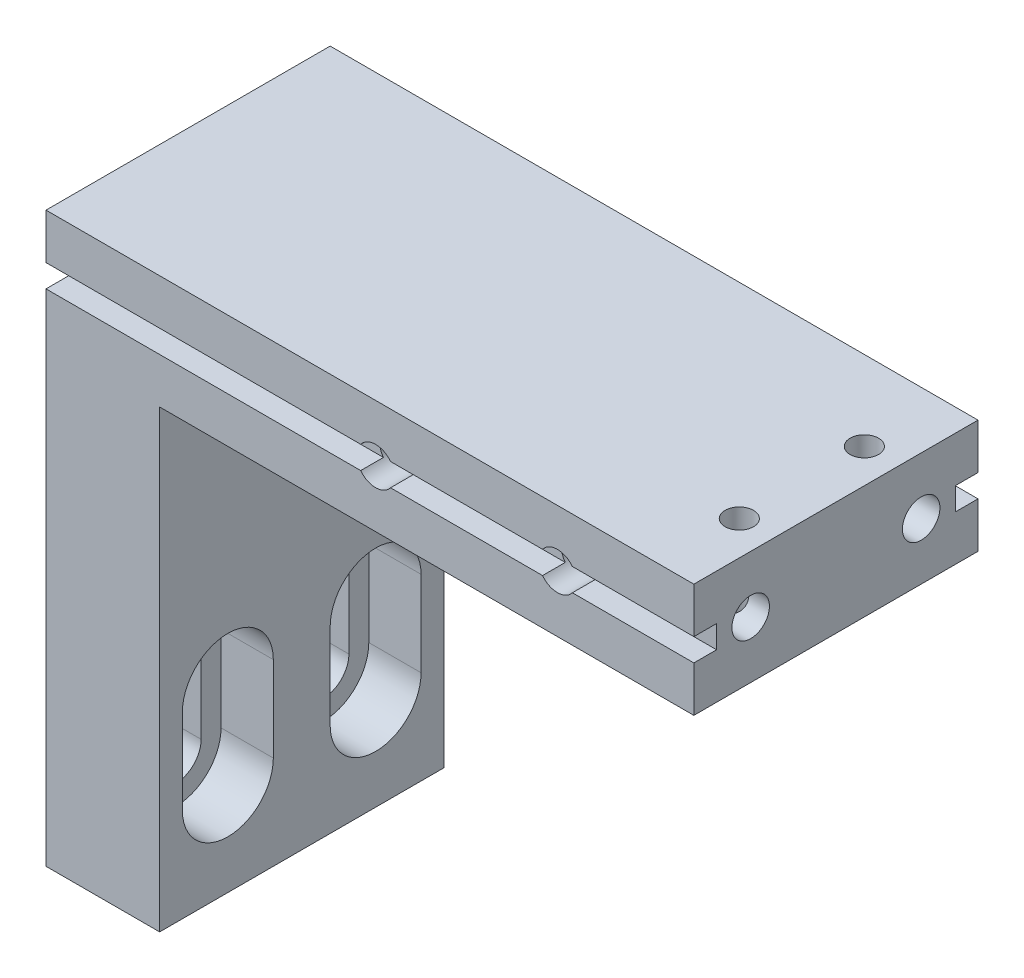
ISO-10303-21;
HEADER;
FILE_DESCRIPTION(('STEP AP214'),'2;1');
FILE_NAME('part.step','',(''),(''),'','','');
FILE_SCHEMA(('AUTOMOTIVE_DESIGN { 1 0 10303 214 1 1 1 1 }'));
ENDSEC;
DATA;
#1=APPLICATION_CONTEXT('core data for automotive mechanical design processes');
#2=APPLICATION_PROTOCOL_DEFINITION('international standard','automotive_design',2000,#1);
#3=PRODUCT_CONTEXT('',#1,'mechanical');
#4=PRODUCT('Part','Part','',(#3));
#5=PRODUCT_RELATED_PRODUCT_CATEGORY('part','',(#4));
#6=PRODUCT_DEFINITION_FORMATION('','',#4);
#7=PRODUCT_DEFINITION_CONTEXT('part definition',#1,'design');
#8=PRODUCT_DEFINITION('design','',#6,#7);
#9=PRODUCT_DEFINITION_SHAPE('','',#8);
#10=(LENGTH_UNIT() NAMED_UNIT(*) SI_UNIT(.MILLI.,.METRE.));
#11=(NAMED_UNIT(*) PLANE_ANGLE_UNIT() SI_UNIT($,.RADIAN.));
#12=(NAMED_UNIT(*) SI_UNIT($,.STERADIAN.) SOLID_ANGLE_UNIT());
#13=UNCERTAINTY_MEASURE_WITH_UNIT(LENGTH_MEASURE(1.E-05),#10,'distance_accuracy_value','');
#14=(GEOMETRIC_REPRESENTATION_CONTEXT(3) GLOBAL_UNCERTAINTY_ASSIGNED_CONTEXT((#13)) GLOBAL_UNIT_ASSIGNED_CONTEXT((#10,
#11,#12)) REPRESENTATION_CONTEXT('',''));
#15=CARTESIAN_POINT('',(0.,0.,0.));
#16=DIRECTION('',(0.,0.,1.));
#17=DIRECTION('',(1.,0.,0.));
#18=AXIS2_PLACEMENT_3D('',#15,#16,#17);
#19=CARTESIAN_POINT('',(167.,-66.7630029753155,0.));
#20=DIRECTION('',(0.,1.,0.));
#21=DIRECTION('',(0.,0.,1.));
#22=AXIS2_PLACEMENT_3D('',#19,#20,#21);
#23=PLANE('',#22);
#24=DIRECTION('',(1.,0.,0.));
#25=VECTOR('',#24,1.);
#26=CARTESIAN_POINT('',(167.,-66.7630029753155,0.));
#27=LINE('',#26,#25);
#28=CARTESIAN_POINT('',(213.31244047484,-66.7630029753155,0.));
#29=VERTEX_POINT('',#28);
#30=CARTESIAN_POINT('',(224.,-66.7630029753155,0.));
#31=VERTEX_POINT('',#30);
#32=EDGE_CURVE('E355',#29,#31,#27,.T.);
#33=ORIENTED_EDGE('',*,*,#32,.F.);
#34=DIRECTION('',(0.,0.,-1.));
#35=VECTOR('',#34,1.);
#36=CARTESIAN_POINT('',(213.31244047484,-66.7630029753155,-25.));
#37=LINE('',#36,#35);
#38=CARTESIAN_POINT('',(213.31244047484,-66.7630029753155,-2.));
#39=VERTEX_POINT('',#38);
#40=EDGE_CURVE('E333',#29,#39,#37,.T.);
#41=ORIENTED_EDGE('',*,*,#40,.T.);
#42=DIRECTION('',(1.,0.,0.));
#43=VECTOR('',#42,1.);
#44=CARTESIAN_POINT('',(167.,-66.7630029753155,-2.));
#45=LINE('',#44,#43);
#46=CARTESIAN_POINT('',(224.,-66.7630029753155,-2.));
#47=VERTEX_POINT('',#46);
#48=EDGE_CURVE('E365',#39,#47,#45,.T.);
#49=ORIENTED_EDGE('',*,*,#48,.T.);
#50=DIRECTION('',(0.,0.,1.));
#51=VECTOR('',#50,1.);
#52=CARTESIAN_POINT('',(224.,-66.7630029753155,0.));
#53=LINE('',#52,#51);
#54=EDGE_CURVE('E361',#47,#31,#53,.T.);
#55=ORIENTED_EDGE('',*,*,#54,.T.);
#56=EDGE_LOOP('',(#33,#41,#49,#55));
#57=FACE_BOUND('',#56,.T.);
#58=ADVANCED_FACE('F16',(#57),#23,.F.);
#59=CARTESIAN_POINT('',(167.,-66.7630029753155,-25.));
#60=DIRECTION('',(0.,1.,0.));
#61=DIRECTION('',(0.,0.,1.));
#62=AXIS2_PLACEMENT_3D('',#59,#60,#61);
#63=PLANE('',#62);
#64=DIRECTION('',(1.,0.,0.));
#65=VECTOR('',#64,1.);
#66=CARTESIAN_POINT('',(167.,-66.7630029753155,-23.));
#67=LINE('',#66,#65);
#68=CARTESIAN_POINT('',(213.31244047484,-66.7630029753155,-23.));
#69=VERTEX_POINT('',#68);
#70=CARTESIAN_POINT('',(224.,-66.7630029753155,-23.));
#71=VERTEX_POINT('',#70);
#72=EDGE_CURVE('E866',#69,#71,#67,.T.);
#73=ORIENTED_EDGE('',*,*,#72,.F.);
#74=DIRECTION('',(0.,0.,-1.));
#75=VECTOR('',#74,1.);
#76=CARTESIAN_POINT('',(213.31244047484,-66.7630029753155,-25.));
#77=LINE('',#76,#75);
#78=CARTESIAN_POINT('',(213.31244047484,-66.7630029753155,-25.));
#79=VERTEX_POINT('',#78);
#80=EDGE_CURVE('E933',#69,#79,#77,.T.);
#81=ORIENTED_EDGE('',*,*,#80,.T.);
#82=DIRECTION('',(1.,0.,0.));
#83=VECTOR('',#82,1.);
#84=CARTESIAN_POINT('',(167.,-66.7630029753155,-25.));
#85=LINE('',#84,#83);
#86=CARTESIAN_POINT('',(224.,-66.7630029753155,-25.));
#87=VERTEX_POINT('',#86);
#88=EDGE_CURVE('E860',#79,#87,#85,.T.);
#89=ORIENTED_EDGE('',*,*,#88,.T.);
#90=DIRECTION('',(0.,0.,1.));
#91=VECTOR('',#90,1.);
#92=CARTESIAN_POINT('',(224.,-66.7630029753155,-25.));
#93=LINE('',#92,#91);
#94=EDGE_CURVE('E875',#87,#71,#93,.T.);
#95=ORIENTED_EDGE('',*,*,#94,.T.);
#96=EDGE_LOOP('',(#73,#81,#89,#95));
#97=FACE_BOUND('',#96,.T.);
#98=ADVANCED_FACE('F710',(#97),#63,.F.);
#99=CARTESIAN_POINT('',(167.,-68.7630029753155,-2.));
#100=DIRECTION('',(0.,0.,-1.));
#101=DIRECTION('',(-1.,0.,0.));
#102=AXIS2_PLACEMENT_3D('',#99,#100,#101);
#103=PLANE('',#102);
#104=ORIENTED_EDGE('',*,*,#48,.F.);
#105=CARTESIAN_POINT('',(212.,-67.7630029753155,-2.));
#106=DIRECTION('',(0.,0.,-1.));
#107=DIRECTION('',(-1.,0.,0.));
#108=AXIS2_PLACEMENT_3D('',#105,#106,#107);
#109=CIRCLE('',#108,1.65);
#110=CARTESIAN_POINT('',(213.31244047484,-68.7630029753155,-2.));
#111=VERTEX_POINT('',#110);
#112=EDGE_CURVE('E920',#39,#111,#109,.T.);
#113=ORIENTED_EDGE('',*,*,#112,.T.);
#114=DIRECTION('',(1.,0.,0.));
#115=VECTOR('',#114,1.);
#116=CARTESIAN_POINT('',(167.,-68.7630029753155,-2.));
#117=LINE('',#116,#115);
#118=CARTESIAN_POINT('',(224.,-68.7630029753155,-2.));
#119=VERTEX_POINT('',#118);
#120=EDGE_CURVE('E370',#111,#119,#117,.T.);
#121=ORIENTED_EDGE('',*,*,#120,.T.);
#122=DIRECTION('',(0.,1.,0.));
#123=VECTOR('',#122,1.);
#124=CARTESIAN_POINT('',(224.,-68.7630029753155,-2.));
#125=LINE('',#124,#123);
#126=EDGE_CURVE('E842',#119,#47,#125,.T.);
#127=ORIENTED_EDGE('',*,*,#126,.T.);
#128=EDGE_LOOP('',(#104,#113,#121,#127));
#129=FACE_BOUND('',#128,.T.);
#130=ADVANCED_FACE('F694',(#129),#103,.F.);
#131=CARTESIAN_POINT('',(167.,-68.7630029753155,0.));
#132=DIRECTION('',(0.,-1.,0.));
#133=DIRECTION('',(0.,0.,-1.));
#134=AXIS2_PLACEMENT_3D('',#131,#132,#133);
#135=PLANE('',#134);
#136=DIRECTION('',(1.,0.,0.));
#137=VECTOR('',#136,1.);
#138=CARTESIAN_POINT('',(167.,-68.7630029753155,0.));
#139=LINE('',#138,#137);
#140=CARTESIAN_POINT('',(197.312440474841,-68.7630029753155,0.));
#141=VERTEX_POINT('',#140);
#142=CARTESIAN_POINT('',(210.68755952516,-68.7630029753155,0.));
#143=VERTEX_POINT('',#142);
#144=EDGE_CURVE('E374',#141,#143,#139,.T.);
#145=ORIENTED_EDGE('',*,*,#144,.T.);
#146=DIRECTION('',(0.,0.,-1.));
#147=VECTOR('',#146,1.);
#148=CARTESIAN_POINT('',(210.68755952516,-68.7630029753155,-25.));
#149=LINE('',#148,#147);
#150=CARTESIAN_POINT('',(210.68755952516,-68.7630029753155,-2.));
#151=VERTEX_POINT('',#150);
#152=EDGE_CURVE('E916',#143,#151,#149,.T.);
#153=ORIENTED_EDGE('',*,*,#152,.T.);
#154=CARTESIAN_POINT('',(197.312440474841,-68.7630029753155,-2.));
#155=VERTEX_POINT('',#154);
#156=EDGE_CURVE('E369',#155,#151,#117,.T.);
#157=ORIENTED_EDGE('',*,*,#156,.F.);
#158=DIRECTION('',(0.,0.,-1.));
#159=VECTOR('',#158,1.);
#160=CARTESIAN_POINT('',(197.312440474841,-68.7630029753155,-25.));
#161=LINE('',#160,#159);
#162=EDGE_CURVE('E899',#155,#141,#161,.F.);
#163=ORIENTED_EDGE('',*,*,#162,.T.);
#164=EDGE_LOOP('',(#145,#153,#157,#163));
#165=FACE_BOUND('',#164,.T.);
#166=ADVANCED_FACE('F689',(#165),#135,.F.);
#167=CARTESIAN_POINT('',(167.,-68.7630029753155,-25.));
#168=DIRECTION('',(0.,-1.,0.));
#169=DIRECTION('',(0.,0.,-1.));
#170=AXIS2_PLACEMENT_3D('',#167,#168,#169);
#171=PLANE('',#170);
#172=DIRECTION('',(1.,0.,0.));
#173=VECTOR('',#172,1.);
#174=CARTESIAN_POINT('',(167.,-68.7630029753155,-23.));
#175=LINE('',#174,#173);
#176=CARTESIAN_POINT('',(197.312440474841,-68.7630029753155,-23.));
#177=VERTEX_POINT('',#176);
#178=CARTESIAN_POINT('',(210.68755952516,-68.7630029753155,-23.));
#179=VERTEX_POINT('',#178);
#180=EDGE_CURVE('E847',#177,#179,#175,.T.);
#181=ORIENTED_EDGE('',*,*,#180,.T.);
#182=DIRECTION('',(0.,0.,-1.));
#183=VECTOR('',#182,1.);
#184=CARTESIAN_POINT('',(210.68755952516,-68.7630029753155,-25.));
#185=LINE('',#184,#183);
#186=CARTESIAN_POINT('',(210.68755952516,-68.7630029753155,-25.));
#187=VERTEX_POINT('',#186);
#188=EDGE_CURVE('E929',#179,#187,#185,.T.);
#189=ORIENTED_EDGE('',*,*,#188,.T.);
#190=DIRECTION('',(1.,0.,0.));
#191=VECTOR('',#190,1.);
#192=CARTESIAN_POINT('',(167.,-68.7630029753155,-25.));
#193=LINE('',#192,#191);
#194=CARTESIAN_POINT('',(197.312440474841,-68.7630029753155,-25.));
#195=VERTEX_POINT('',#194);
#196=EDGE_CURVE('E861',#195,#187,#193,.T.);
#197=ORIENTED_EDGE('',*,*,#196,.F.);
#198=DIRECTION('',(0.,0.,-1.));
#199=VECTOR('',#198,1.);
#200=CARTESIAN_POINT('',(197.312440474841,-68.7630029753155,-25.));
#201=LINE('',#200,#199);
#202=EDGE_CURVE('E902',#195,#177,#201,.F.);
#203=ORIENTED_EDGE('',*,*,#202,.T.);
#204=EDGE_LOOP('',(#181,#189,#197,#203));
#205=FACE_BOUND('',#204,.T.);
#206=ADVANCED_FACE('F703',(#205),#171,.F.);
#207=CARTESIAN_POINT('',(167.,-68.7630029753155,-23.));
#208=DIRECTION('',(0.,0.,1.));
#209=DIRECTION('',(1.,0.,0.));
#210=AXIS2_PLACEMENT_3D('',#207,#208,#209);
#211=PLANE('',#210);
#212=CARTESIAN_POINT('',(197.312440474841,-66.7630029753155,-23.));
#213=VERTEX_POINT('',#212);
#214=CARTESIAN_POINT('',(210.68755952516,-66.7630029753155,-23.));
#215=VERTEX_POINT('',#214);
#216=EDGE_CURVE('E870',#213,#215,#67,.T.);
#217=ORIENTED_EDGE('',*,*,#216,.T.);
#218=CARTESIAN_POINT('',(212.,-67.7630029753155,-23.));
#219=DIRECTION('',(0.,0.,1.));
#220=DIRECTION('',(1.,0.,0.));
#221=AXIS2_PLACEMENT_3D('',#218,#219,#220);
#222=CIRCLE('',#221,1.65);
#223=EDGE_CURVE('E932',#215,#179,#222,.T.);
#224=ORIENTED_EDGE('',*,*,#223,.T.);
#225=ORIENTED_EDGE('',*,*,#180,.F.);
#226=CARTESIAN_POINT('',(196.,-67.7630029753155,-23.));
#227=DIRECTION('',(0.,0.,1.));
#228=DIRECTION('',(1.,0.,0.));
#229=AXIS2_PLACEMENT_3D('',#226,#227,#228);
#230=CIRCLE('',#229,1.65);
#231=EDGE_CURVE('E905',#177,#213,#230,.T.);
#232=ORIENTED_EDGE('',*,*,#231,.T.);
#233=EDGE_LOOP('',(#217,#224,#225,#232));
#234=FACE_BOUND('',#233,.T.);
#235=ADVANCED_FACE('F715',(#234),#211,.F.);
#236=CARTESIAN_POINT('',(224.,-67.7630029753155,-20.));
#237=DIRECTION('',(1.,0.,0.));
#238=DIRECTION('',(0.,0.,-1.));
#239=AXIS2_PLACEMENT_3D('',#236,#237,#238);
#240=CYLINDRICAL_SURFACE('',#239,1.65);
#241=CARTESIAN_POINT('',(224.,-67.7630029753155,-20.));
#242=DIRECTION('',(1.,0.,0.));
#243=DIRECTION('',(0.,0.,-1.));
#244=AXIS2_PLACEMENT_3D('',#241,#242,#243);
#245=CIRCLE('',#244,1.65);
#246=CARTESIAN_POINT('',(224.,-67.7630029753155,-21.65));
#247=VERTEX_POINT('',#246);
#248=EDGE_CURVE('E523',#247,#247,#245,.T.);
#249=ORIENTED_EDGE('',*,*,#248,.T.);
#250=EDGE_LOOP('',(#249));
#251=FACE_BOUND('',#250,.T.);
#252=CARTESIAN_POINT('',(221.,-66.2933091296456,-19.25));
#253=CARTESIAN_POINT('',(220.938634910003,-66.293306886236,-19.2499942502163));
#254=CARTESIAN_POINT('',(220.877195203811,-66.2955997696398,-19.2454568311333));
#255=CARTESIAN_POINT('',(220.755895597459,-66.3049909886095,-19.2274721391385));
#256=CARTESIAN_POINT('',(220.696039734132,-66.3121005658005,-19.2140040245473));
#257=CARTESIAN_POINT('',(220.579694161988,-66.3317408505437,-19.1787848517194));
#258=CARTESIAN_POINT('',(220.52320615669,-66.3442742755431,-19.1570296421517));
#259=CARTESIAN_POINT('',(220.415394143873,-66.3755658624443,-19.106470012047));
#260=CARTESIAN_POINT('',(220.364065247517,-66.3943180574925,-19.0776723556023));
#261=CARTESIAN_POINT('',(220.269112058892,-66.4382888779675,-19.0156019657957));
#262=CARTESIAN_POINT('',(220.22533945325,-66.4633512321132,-18.9824455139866));
#263=CARTESIAN_POINT('',(220.145074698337,-66.5204553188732,-18.9134579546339));
#264=CARTESIAN_POINT('',(220.10858204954,-66.5524965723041,-18.8776270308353));
#265=CARTESIAN_POINT('',(220.043638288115,-66.6227765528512,-18.8063298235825));
#266=CARTESIAN_POINT('',(220.015073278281,-66.6609135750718,-18.7708662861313));
#267=CARTESIAN_POINT('',(219.964799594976,-66.7430253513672,-18.7019155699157));
#268=CARTESIAN_POINT('',(219.943093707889,-66.7870024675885,-18.6684291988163));
#269=CARTESIAN_POINT('',(219.903950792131,-66.8839578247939,-18.6023162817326));
#270=CARTESIAN_POINT('',(219.887064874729,-66.9373887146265,-18.5700308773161));
#271=CARTESIAN_POINT('',(219.858880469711,-67.0487257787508,-18.5112820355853));
#272=CARTESIAN_POINT('',(219.847585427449,-67.1066346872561,-18.4848221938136));
#273=CARTESIAN_POINT('',(219.827610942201,-67.2361259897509,-18.4345847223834));
#274=CARTESIAN_POINT('',(219.819734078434,-67.3083288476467,-18.412084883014));
#275=CARTESIAN_POINT('',(219.808113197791,-67.4554524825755,-18.3771498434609));
#276=CARTESIAN_POINT('',(219.804371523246,-67.5303747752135,-18.3647203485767));
#277=CARTESIAN_POINT('',(219.799765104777,-67.6914642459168,-18.349311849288));
#278=CARTESIAN_POINT('',(219.799353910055,-67.7777909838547,-18.3478252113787));
#279=CARTESIAN_POINT('',(219.802448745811,-67.9496100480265,-18.3583259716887));
#280=CARTESIAN_POINT('',(219.805957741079,-68.0351016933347,-18.3703235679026));
#281=CARTESIAN_POINT('',(219.818280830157,-68.2055278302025,-18.4079811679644));
#282=CARTESIAN_POINT('',(219.827259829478,-68.2903584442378,-18.4340628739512));
#283=CARTESIAN_POINT('',(219.853364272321,-68.4536509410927,-18.4989405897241));
#284=CARTESIAN_POINT('',(219.870476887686,-68.5321226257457,-18.5377165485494));
#285=CARTESIAN_POINT('',(219.910648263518,-68.6607688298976,-18.6141343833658));
#286=CARTESIAN_POINT('',(219.931098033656,-68.7130723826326,-18.6495694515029));
#287=CARTESIAN_POINT('',(219.980061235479,-68.810922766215,-18.7240187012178));
#288=CARTESIAN_POINT('',(220.008566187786,-68.8564766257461,-18.7630290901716));
#289=CARTESIAN_POINT('',(220.074806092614,-68.9399347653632,-18.8421307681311));
#290=CARTESIAN_POINT('',(220.112595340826,-68.9777915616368,-18.8822271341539));
#291=CARTESIAN_POINT('',(220.1972866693,-69.0449453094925,-18.9599186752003));
#292=CARTESIAN_POINT('',(220.244187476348,-69.0742434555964,-18.9975141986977));
#293=CARTESIAN_POINT('',(220.340785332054,-69.1220263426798,-19.06348926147));
#294=CARTESIAN_POINT('',(220.389721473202,-69.1413043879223,-19.0924161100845));
#295=CARTESIAN_POINT('',(220.492690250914,-69.1738465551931,-19.1438746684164));
#296=CARTESIAN_POINT('',(220.546723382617,-69.1871100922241,-19.1664057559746));
#297=CARTESIAN_POINT('',(220.658307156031,-69.2083683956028,-19.2038312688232));
#298=CARTESIAN_POINT('',(220.715855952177,-69.2163659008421,-19.2187296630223));
#299=CARTESIAN_POINT('',(220.832930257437,-69.2277124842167,-19.2402144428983));
#300=CARTESIAN_POINT('',(220.892456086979,-69.2310608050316,-19.2467994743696));
#301=CARTESIAN_POINT('',(221.014110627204,-69.2334413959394,-19.2514548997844));
#302=CARTESIAN_POINT('',(221.076254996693,-69.2323115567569,-19.249205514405));
#303=CARTESIAN_POINT('',(221.19926549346,-69.2252608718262,-19.2355657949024));
#304=CARTESIAN_POINT('',(221.260131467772,-69.2193394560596,-19.2241743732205));
#305=CARTESIAN_POINT('',(221.379218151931,-69.2021251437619,-19.1926897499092));
#306=CARTESIAN_POINT('',(221.437419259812,-69.1907978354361,-19.1725408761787));
#307=CARTESIAN_POINT('',(221.54894604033,-69.1619446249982,-19.1246494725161));
#308=CARTESIAN_POINT('',(221.602273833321,-69.144421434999,-19.096910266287));
#309=CARTESIAN_POINT('',(221.700883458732,-69.103008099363,-19.0365808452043));
#310=CARTESIAN_POINT('',(221.746363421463,-69.0793320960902,-19.0041676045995));
#311=CARTESIAN_POINT('',(221.830120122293,-69.0249615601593,-18.9361157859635));
#312=CARTESIAN_POINT('',(221.86839885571,-68.9942689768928,-18.9004781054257));
#313=CARTESIAN_POINT('',(221.936570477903,-68.9267388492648,-18.829286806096));
#314=CARTESIAN_POINT('',(221.966629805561,-68.8900518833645,-18.7937486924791));
#315=CARTESIAN_POINT('',(222.019777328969,-68.8106842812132,-18.7242060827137));
#316=CARTESIAN_POINT('',(222.042862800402,-68.7680013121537,-18.6902021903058));
#317=CARTESIAN_POINT('',(222.084412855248,-68.6741359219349,-18.6230789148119));
#318=CARTESIAN_POINT('',(222.102394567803,-68.6225544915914,-18.5902219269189));
#319=CARTESIAN_POINT('',(222.132623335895,-68.5147734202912,-18.5299097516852));
#320=CARTESIAN_POINT('',(222.144866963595,-68.4585710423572,-18.5024577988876));
#321=CARTESIAN_POINT('',(222.166684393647,-68.3328380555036,-18.4497776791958));
#322=CARTESIAN_POINT('',(222.175444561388,-68.2626709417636,-18.425730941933));
#323=CARTESIAN_POINT('',(222.188681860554,-68.1193636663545,-18.3872304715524));
#324=CARTESIAN_POINT('',(222.193156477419,-68.0462217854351,-18.3727823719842));
#325=CARTESIAN_POINT('',(222.199316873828,-67.887857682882,-18.3525283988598));
#326=CARTESIAN_POINT('',(222.200507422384,-67.8024144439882,-18.3482692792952));
#327=CARTESIAN_POINT('',(222.199120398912,-67.6318749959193,-18.3530054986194));
#328=CARTESIAN_POINT('',(222.196540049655,-67.5467790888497,-18.3620106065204));
#329=CARTESIAN_POINT('',(222.186522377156,-67.375706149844,-18.3936442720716));
#330=CARTESIAN_POINT('',(222.178885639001,-67.2898421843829,-18.4168290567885));
#331=CARTESIAN_POINT('',(222.156139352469,-67.123833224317,-18.4762881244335));
#332=CARTESIAN_POINT('',(222.14103940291,-67.0436810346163,-18.5125455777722));
#333=CARTESIAN_POINT('',(222.104756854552,-66.9103018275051,-18.5858759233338));
#334=CARTESIAN_POINT('',(222.085879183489,-66.8552083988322,-18.6206983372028));
#335=CARTESIAN_POINT('',(222.040081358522,-66.7516954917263,-18.6947072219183));
#336=CARTESIAN_POINT('',(222.013169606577,-66.7032691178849,-18.7338891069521));
#337=CARTESIAN_POINT('',(221.949858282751,-66.6141081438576,-18.814181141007));
#338=CARTESIAN_POINT('',(221.913395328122,-66.5734281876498,-18.8553026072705));
#339=CARTESIAN_POINT('',(221.830829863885,-66.5009832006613,-18.9356966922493));
#340=CARTESIAN_POINT('',(221.784731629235,-66.4692142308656,-18.9749701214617));
#341=CARTESIAN_POINT('',(221.689695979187,-66.4175836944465,-19.0439682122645));
#342=CARTESIAN_POINT('',(221.641685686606,-66.3967760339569,-19.0742712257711));
#343=CARTESIAN_POINT('',(221.540151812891,-66.3614089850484,-19.1287403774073));
#344=CARTESIAN_POINT('',(221.486624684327,-66.3468536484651,-19.152902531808));
#345=CARTESIAN_POINT('',(221.376246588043,-66.3233671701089,-19.1934677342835));
#346=CARTESIAN_POINT('',(221.319436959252,-66.3143779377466,-19.2099504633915));
#347=CARTESIAN_POINT('',(221.203626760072,-66.3011393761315,-19.234718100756));
#348=CARTESIAN_POINT('',(221.144631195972,-66.296879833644,-19.2430206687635));
#349=CARTESIAN_POINT('',(221.056942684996,-66.2938055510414,-19.2490292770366));
#350=CARTESIAN_POINT('',(221.028479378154,-66.2933101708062,-19.2500026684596));
#351=CARTESIAN_POINT('',(221.,-66.2933091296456,-19.25));
#352=B_SPLINE_CURVE_WITH_KNOTS('',3,(#252,#253,#254,#255,#256,#257,#258,#259,#260,#261,#262,
#263,#264,#265,#266,#267,#268,#269,#270,#271,#272,#273,#274,#275,#276,#277,#278,#279,#280,#281,
#282,#283,#284,#285,#286,#287,#288,#289,#290,#291,#292,#293,#294,#295,#296,#297,#298,#299,#300,
#301,#302,#303,#304,#305,#306,#307,#308,#309,#310,#311,#312,#313,#314,#315,#316,#317,#318,#319,
#320,#321,#322,#323,#324,#325,#326,#327,#328,#329,#330,#331,#332,#333,#334,#335,#336,#337,#338,
#339,#340,#341,#342,#343,#344,#345,#346,#347,#348,#349,#350,#351),.UNSPECIFIED.,.T.,.F.,(4,2,2,
2,2,2,2,2,2,2,2,2,2,2,2,2,2,2,2,2,2,2,2,2,2,2,2,2,2,2,2,2,2,2,2,2,2,2,2,2,2,2,2,2,2,2,2,2,2,4),
(0.,0.184014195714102,0.368459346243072,0.552997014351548,0.737358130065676,0.917538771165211,
1.09770704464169,1.27513423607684,1.45263341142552,1.6459136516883,1.83931285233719,
2.06652565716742,2.29386709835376,2.55172238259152,2.80977281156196,3.07601664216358,
3.34184194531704,3.54024513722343,3.73844025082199,3.93782323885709,4.13717838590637,
4.3163978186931,4.49563467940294,4.67477824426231,4.85395098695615,5.03966795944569,
5.22540702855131,5.41234453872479,5.59920032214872,5.78026540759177,5.9612802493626,
6.13829986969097,6.31538855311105,6.50589983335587,6.69652477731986,6.91972096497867,
7.14304803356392,7.39858089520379,7.65430204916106,7.92076204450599,8.18688022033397,
8.38962345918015,8.59215540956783,8.79606701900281,8.99988834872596,9.18040749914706,
9.36104345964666,9.53976095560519,9.71809177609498,9.80349228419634),.UNSPECIFIED.);
#353=CARTESIAN_POINT('',(221.,-66.2933091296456,-19.25));
#354=VERTEX_POINT('',#353);
#355=EDGE_CURVE('E509',#354,#354,#352,.T.);
#356=ORIENTED_EDGE('',*,*,#355,.T.);
#357=EDGE_LOOP('',(#356));
#358=FACE_BOUND('',#357,.T.);
#359=CARTESIAN_POINT('',(212.,-67.7630029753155,-20.));
#360=DIRECTION('',(0.707106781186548,0.,0.707106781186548));
#361=DIRECTION('',(0.707106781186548,0.,-0.707106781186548));
#362=AXIS2_PLACEMENT_3D('',#359,#360,#361);
#363=ELLIPSE('',#362,2.33345237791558,1.65);
#364=CARTESIAN_POINT('',(212.,-66.1130029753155,-20.));
#365=VERTEX_POINT('',#364);
#366=CARTESIAN_POINT('',(212.,-69.4130029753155,-20.));
#367=VERTEX_POINT('',#366);
#368=EDGE_CURVE('E30',#365,#367,#363,.F.);
#369=ORIENTED_EDGE('',*,*,#368,.T.);
#370=CARTESIAN_POINT('',(212.,-67.7630029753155,-20.));
#371=DIRECTION('',(0.707106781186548,0.,-0.707106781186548));
#372=DIRECTION('',(0.707106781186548,0.,0.707106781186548));
#373=AXIS2_PLACEMENT_3D('',#370,#371,#372);
#374=ELLIPSE('',#373,2.33345237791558,1.65);
#375=EDGE_CURVE('E942',#367,#365,#374,.F.);
#376=ORIENTED_EDGE('',*,*,#375,.T.);
#377=EDGE_LOOP('',(#369,#376));
#378=FACE_BOUND('',#377,.T.);
#379=ADVANCED_FACE('F755',(#251,#358,#378),#240,.F.);
#380=CARTESIAN_POINT('',(224.,-67.7630029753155,-5.));
#381=DIRECTION('',(1.,0.,0.));
#382=DIRECTION('',(0.,0.,-1.));
#383=AXIS2_PLACEMENT_3D('',#380,#381,#382);
#384=CYLINDRICAL_SURFACE('',#383,1.65);
#385=CARTESIAN_POINT('',(224.,-67.7630029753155,-5.));
#386=DIRECTION('',(1.,0.,0.));
#387=DIRECTION('',(0.,0.,-1.));
#388=AXIS2_PLACEMENT_3D('',#385,#386,#387);
#389=CIRCLE('',#388,1.65);
#390=CARTESIAN_POINT('',(224.,-67.7630029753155,-6.65));
#391=VERTEX_POINT('',#390);
#392=EDGE_CURVE('E517',#391,#391,#389,.T.);
#393=ORIENTED_EDGE('',*,*,#392,.T.);
#394=EDGE_LOOP('',(#393));
#395=FACE_BOUND('',#394,.T.);
#396=CARTESIAN_POINT('',(219.8,-67.7630029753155,-6.65));
#397=CARTESIAN_POINT('',(219.799995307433,-67.6764621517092,-6.64999677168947));
#398=CARTESIAN_POINT('',(219.801931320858,-67.5897884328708,-6.6431575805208));
#399=CARTESIAN_POINT('',(219.810360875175,-67.4186179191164,-6.61599734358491));
#400=CARTESIAN_POINT('',(219.816867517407,-67.3341281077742,-6.59563755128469));
#401=CARTESIAN_POINT('',(219.836565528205,-67.1695936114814,-6.54202634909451));
#402=CARTESIAN_POINT('',(219.84978597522,-67.089569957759,-6.50871900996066));
#403=CARTESIAN_POINT('',(219.876989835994,-66.9756222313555,-6.45064170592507));
#404=CARTESIAN_POINT('',(219.887277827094,-66.9386757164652,-6.42994552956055));
#405=CARTESIAN_POINT('',(219.910764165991,-66.8671517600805,-6.38625510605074));
#406=CARTESIAN_POINT('',(219.923961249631,-66.8325732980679,-6.36326185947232));
#407=CARTESIAN_POINT('',(219.96034022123,-66.7513717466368,-6.30483177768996));
#408=CARTESIAN_POINT('',(219.98535150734,-66.7062413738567,-6.26841300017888));
#409=CARTESIAN_POINT('',(220.043346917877,-66.6229040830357,-6.19406623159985));
#410=CARTESIAN_POINT('',(220.076324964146,-66.5846919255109,-6.15613940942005));
#411=CARTESIAN_POINT('',(220.150675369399,-66.5156847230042,-6.08134188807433));
#412=CARTESIAN_POINT('',(220.192078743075,-66.4849180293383,-6.04447568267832));
#413=CARTESIAN_POINT('',(220.282566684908,-66.4310015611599,-5.97479378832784));
#414=CARTESIAN_POINT('',(220.331652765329,-66.4078532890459,-5.9419788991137));
#415=CARTESIAN_POINT('',(220.432769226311,-66.3698297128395,-5.88469165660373));
#416=CARTESIAN_POINT('',(220.484413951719,-66.3545219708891,-5.85982152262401));
#417=CARTESIAN_POINT('',(220.59177369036,-66.3293288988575,-5.81712644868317));
#418=CARTESIAN_POINT('',(220.647489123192,-66.3194441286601,-5.79930223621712));
#419=CARTESIAN_POINT('',(220.76277682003,-66.3042583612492,-5.77125017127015));
#420=CARTESIAN_POINT('',(220.822408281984,-66.2990678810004,-5.76120623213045));
#421=CARTESIAN_POINT('',(220.942720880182,-66.2932193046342,-5.74985108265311));
#422=CARTESIAN_POINT('',(221.003402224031,-66.2925621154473,-5.74854161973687));
#423=CARTESIAN_POINT('',(221.126064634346,-66.2957700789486,-5.75481229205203));
#424=CARTESIAN_POINT('',(221.188028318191,-66.2997748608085,-5.76266691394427));
#425=CARTESIAN_POINT('',(221.30958408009,-66.3129124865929,-5.78735718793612));
#426=CARTESIAN_POINT('',(221.369176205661,-66.3220452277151,-5.80419265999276));
#427=CARTESIAN_POINT('',(221.48386676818,-66.3460992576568,-5.84584609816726));
#428=CARTESIAN_POINT('',(221.538989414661,-66.3609864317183,-5.87061687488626));
#429=CARTESIAN_POINT('',(221.643406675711,-66.3973932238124,-5.92667127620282));
#430=CARTESIAN_POINT('',(221.692704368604,-66.4189093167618,-5.95795143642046));
#431=CARTESIAN_POINT('',(221.78242677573,-66.4682868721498,-6.02363527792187));
#432=CARTESIAN_POINT('',(221.823110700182,-66.4958865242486,-6.05788222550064));
#433=CARTESIAN_POINT('',(221.897115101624,-66.5579386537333,-6.12805515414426));
#434=CARTESIAN_POINT('',(221.93043585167,-66.5923908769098,-6.16398107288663));
#435=CARTESIAN_POINT('',(221.989730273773,-66.6676845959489,-6.23509355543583));
#436=CARTESIAN_POINT('',(222.015707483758,-66.7085230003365,-6.27028046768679));
#437=CARTESIAN_POINT('',(222.061033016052,-66.7957582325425,-6.33790456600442));
#438=CARTESIAN_POINT('',(222.080378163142,-66.8421577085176,-6.37034042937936));
#439=CARTESIAN_POINT('',(222.115351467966,-66.944939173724,-6.43434065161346));
#440=CARTESIAN_POINT('',(222.130320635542,-67.0018571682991,-6.46540050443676));
#441=CARTESIAN_POINT('',(222.154946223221,-67.1198991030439,-6.52091542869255));
#442=CARTESIAN_POINT('',(222.164599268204,-67.1810256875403,-6.54536629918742));
#443=CARTESIAN_POINT('',(222.181336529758,-67.3173479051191,-6.59057172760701));
#444=CARTESIAN_POINT('',(222.187659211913,-67.3931130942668,-6.60989687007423));
#445=CARTESIAN_POINT('',(222.196414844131,-67.5468368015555,-6.63764655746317));
#446=CARTESIAN_POINT('',(222.198845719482,-67.6247964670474,-6.64606528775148));
#447=CARTESIAN_POINT('',(222.200611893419,-67.7901270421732,-6.6520763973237));
#448=CARTESIAN_POINT('',(222.19956155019,-67.8775550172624,-6.64832113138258));
#449=CARTESIAN_POINT('',(222.193126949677,-68.0506192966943,-6.6270812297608));
#450=CARTESIAN_POINT('',(222.187739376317,-68.1362541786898,-6.60958608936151));
#451=CARTESIAN_POINT('',(222.17071163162,-68.3043825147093,-6.56113166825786));
#452=CARTESIAN_POINT('',(222.158987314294,-68.3868173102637,-6.52999228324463));
#453=CARTESIAN_POINT('',(222.134364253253,-68.5047250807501,-6.47453290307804));
#454=CARTESIAN_POINT('',(222.124988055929,-68.5430585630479,-6.45459608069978));
#455=CARTESIAN_POINT('',(222.103419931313,-68.6174498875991,-6.41217938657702));
#456=CARTESIAN_POINT('',(222.091229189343,-68.6535086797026,-6.38970058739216));
#457=CARTESIAN_POINT('',(222.057375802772,-68.7384618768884,-6.33215881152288));
#458=CARTESIAN_POINT('',(222.033914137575,-68.7859012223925,-6.29595741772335));
#459=CARTESIAN_POINT('',(221.97897006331,-68.8738871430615,-6.2213770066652));
#460=CARTESIAN_POINT('',(221.947495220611,-68.9144401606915,-6.18300007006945));
#461=CARTESIAN_POINT('',(221.875855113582,-68.9880405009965,-6.10662174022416));
#462=CARTESIAN_POINT('',(221.835651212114,-69.0210530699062,-6.0686228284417));
#463=CARTESIAN_POINT('',(221.747094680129,-69.079154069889,-5.99619877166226));
#464=CARTESIAN_POINT('',(221.698741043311,-69.1042415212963,-5.96177406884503));
#465=CARTESIAN_POINT('',(221.59917736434,-69.1453776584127,-5.90153970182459));
#466=CARTESIAN_POINT('',(221.548464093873,-69.1619685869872,-5.8752740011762));
#467=CARTESIAN_POINT('',(221.442631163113,-69.1895459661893,-5.82957236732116));
#468=CARTESIAN_POINT('',(221.387511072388,-69.2005318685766,-5.81013710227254));
#469=CARTESIAN_POINT('',(221.273469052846,-69.2177398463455,-5.77882448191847));
#470=CARTESIAN_POINT('',(221.21449970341,-69.2238811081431,-5.76707587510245));
#471=CARTESIAN_POINT('',(221.0951883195,-69.231606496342,-5.75217961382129));
#472=CARTESIAN_POINT('',(221.034846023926,-69.2331897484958,-5.74903360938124));
#473=CARTESIAN_POINT('',(220.912374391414,-69.2319198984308,-5.75152280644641));
#474=CARTESIAN_POINT('',(220.850252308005,-69.2289176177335,-5.75745330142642));
#475=CARTESIAN_POINT('',(220.728000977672,-69.2179141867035,-5.77837752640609));
#476=CARTESIAN_POINT('',(220.667871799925,-69.2099128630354,-5.79337157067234));
#477=CARTESIAN_POINT('',(220.55147768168,-69.1882608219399,-5.83163689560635));
#478=CARTESIAN_POINT('',(220.495206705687,-69.1746191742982,-5.85489487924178));
#479=CARTESIAN_POINT('',(220.388183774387,-69.1408408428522,-5.90832547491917));
#480=CARTESIAN_POINT('',(220.337428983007,-69.120707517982,-5.93849450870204));
#481=CARTESIAN_POINT('',(220.244576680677,-69.0740710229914,-6.00255041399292));
#482=CARTESIAN_POINT('',(220.202236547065,-69.0478182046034,-6.03626814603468));
#483=CARTESIAN_POINT('',(220.124892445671,-68.9883816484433,-6.10590985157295));
#484=CARTESIAN_POINT('',(220.089887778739,-68.955198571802,-6.14183361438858));
#485=CARTESIAN_POINT('',(220.027614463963,-68.8825662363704,-6.21311250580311));
#486=CARTESIAN_POINT('',(220.000279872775,-68.8431752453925,-6.24846985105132));
#487=CARTESIAN_POINT('',(219.952365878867,-68.7586904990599,-6.31683834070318));
#488=CARTESIAN_POINT('',(219.931788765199,-68.7135948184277,-6.34984868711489));
#489=CARTESIAN_POINT('',(219.894634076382,-68.6139638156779,-6.41500927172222));
#490=CARTESIAN_POINT('',(219.878659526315,-68.5589356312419,-6.44674587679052));
#491=CARTESIAN_POINT('',(219.852161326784,-68.4444986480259,-6.50405156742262));
#492=CARTESIAN_POINT('',(219.841643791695,-68.3850850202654,-6.52961371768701));
#493=CARTESIAN_POINT('',(219.823189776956,-68.2523080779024,-6.57762800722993));
#494=CARTESIAN_POINT('',(219.816044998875,-68.1783430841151,-6.59871851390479));
#495=CARTESIAN_POINT('',(219.805780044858,-68.0280311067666,-6.630383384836));
#496=CARTESIAN_POINT('',(219.802653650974,-67.9516879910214,-6.64097399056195));
#497=CARTESIAN_POINT('',(219.800743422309,-67.8563896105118,-6.64746152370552));
#498=CARTESIAN_POINT('',(219.80046375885,-67.8377269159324,-6.64841293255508));
#499=CARTESIAN_POINT('',(219.800092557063,-67.8003792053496,-6.64968251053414));
#500=CARTESIAN_POINT('',(219.800001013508,-67.7816941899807,-6.65000069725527));
#501=CARTESIAN_POINT('',(219.8,-67.7630029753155,-6.65));
#502=B_SPLINE_CURVE_WITH_KNOTS('',3,(#396,#397,#398,#399,#400,#401,#402,#403,#404,#405,#406,
#407,#408,#409,#410,#411,#412,#413,#414,#415,#416,#417,#418,#419,#420,#421,#422,#423,#424,#425,
#426,#427,#428,#429,#430,#431,#432,#433,#434,#435,#436,#437,#438,#439,#440,#441,#442,#443,#444,
#445,#446,#447,#448,#449,#450,#451,#452,#453,#454,#455,#456,#457,#458,#459,#460,#461,#462,#463,
#464,#465,#466,#467,#468,#469,#470,#471,#472,#473,#474,#475,#476,#477,#478,#479,#480,#481,#482,
#483,#484,#485,#486,#487,#488,#489,#490,#491,#492,#493,#494,#495,#496,#497,#498,#499,#500,#501),
.UNSPECIFIED.,.T.,.F.,(4,2,2,2,2,2,2,2,2,2,2,2,2,2,2,2,2,2,2,2,2,2,2,2,2,2,2,2,2,2,2,2,2,2,2,2,
2,2,2,2,2,2,2,2,2,2,2,2,2,2,2,2,4),(0.,0.259552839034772,0.519852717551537,0.781289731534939,
0.911843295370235,1.04234023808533,1.2309443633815,1.41940504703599,1.6085724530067,
1.79777714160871,1.97495157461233,2.15214429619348,2.33340756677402,2.51470709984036,
2.70157943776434,2.88844802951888,3.07422536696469,3.25990408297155,3.43876943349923,
3.61762814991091,3.79640054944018,3.97525842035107,4.17414885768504,4.3731654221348,
4.60755507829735,4.84206964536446,5.10339303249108,5.36491640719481,5.63000108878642,
5.7624560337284,5.89485529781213,6.08635304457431,6.27767063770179,6.46985297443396,
6.66205905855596,6.8396500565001,7.01725842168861,7.197770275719,7.37831675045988,
7.56486318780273,7.7514160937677,7.93767017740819,8.12382804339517,8.30340478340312,
8.48296440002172,8.66092933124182,8.83895448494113,9.03472287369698,9.23071014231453,
9.46155327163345,9.69203876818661,9.74809893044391,9.8041575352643),.UNSPECIFIED.);
#503=CARTESIAN_POINT('',(219.8,-67.7630029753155,-6.65));
#504=VERTEX_POINT('',#503);
#505=EDGE_CURVE('E516',#504,#504,#502,.T.);
#506=ORIENTED_EDGE('',*,*,#505,.T.);
#507=EDGE_LOOP('',(#506));
#508=FACE_BOUND('',#507,.T.);
#509=CARTESIAN_POINT('',(212.,-67.7630029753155,-5.));
#510=DIRECTION('',(0.707106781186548,0.,0.707106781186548));
#511=DIRECTION('',(0.707106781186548,0.,-0.707106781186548));
#512=AXIS2_PLACEMENT_3D('',#509,#510,#511);
#513=ELLIPSE('',#512,2.33345237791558,1.65);
#514=CARTESIAN_POINT('',(212.,-66.1130029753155,-5.));
#515=VERTEX_POINT('',#514);
#516=CARTESIAN_POINT('',(212.,-69.4130029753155,-5.));
#517=VERTEX_POINT('',#516);
#518=EDGE_CURVE('E36',#515,#517,#513,.F.);
#519=ORIENTED_EDGE('',*,*,#518,.T.);
#520=CARTESIAN_POINT('',(212.,-67.7630029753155,-5.));
#521=DIRECTION('',(0.707106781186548,0.,-0.707106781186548));
#522=DIRECTION('',(0.707106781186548,0.,0.707106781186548));
#523=AXIS2_PLACEMENT_3D('',#520,#521,#522);
#524=ELLIPSE('',#523,2.33345237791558,1.65);
#525=EDGE_CURVE('E11',#517,#515,#524,.F.);
#526=ORIENTED_EDGE('',*,*,#525,.T.);
#527=EDGE_LOOP('',(#519,#526));
#528=FACE_BOUND('',#527,.T.);
#529=ADVANCED_FACE('F736',(#395,#508,#528),#384,.F.);
#530=CARTESIAN_POINT('',(197.312440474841,-66.7630029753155,-2.));
#531=VERTEX_POINT('',#530);
#532=CARTESIAN_POINT('',(210.68755952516,-66.7630029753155,-2.));
#533=VERTEX_POINT('',#532);
#534=EDGE_CURVE('E346',#531,#533,#45,.T.);
#535=ORIENTED_EDGE('',*,*,#534,.T.);
#536=DIRECTION('',(0.,0.,-1.));
#537=VECTOR('',#536,1.);
#538=CARTESIAN_POINT('',(210.68755952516,-66.7630029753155,-25.));
#539=LINE('',#538,#537);
#540=CARTESIAN_POINT('',(210.68755952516,-66.7630029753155,0.));
#541=VERTEX_POINT('',#540);
#542=EDGE_CURVE('E330',#533,#541,#539,.F.);
#543=ORIENTED_EDGE('',*,*,#542,.T.);
#544=CARTESIAN_POINT('',(197.312440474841,-66.7630029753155,0.));
#545=VERTEX_POINT('',#544);
#546=EDGE_CURVE('E344',#545,#541,#27,.T.);
#547=ORIENTED_EDGE('',*,*,#546,.F.);
#548=DIRECTION('',(0.,0.,-1.));
#549=VECTOR('',#548,1.);
#550=CARTESIAN_POINT('',(197.312440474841,-66.7630029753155,-25.));
#551=LINE('',#550,#549);
#552=EDGE_CURVE('E894',#545,#531,#551,.T.);
#553=ORIENTED_EDGE('',*,*,#552,.T.);
#554=EDGE_LOOP('',(#535,#543,#547,#553));
#555=FACE_BOUND('',#554,.T.);
#556=ADVANCED_FACE('F342',(#555),#23,.F.);
#557=ORIENTED_EDGE('',*,*,#156,.T.);
#558=EDGE_CURVE('E348',#151,#533,#109,.T.);
#559=ORIENTED_EDGE('',*,*,#558,.T.);
#560=ORIENTED_EDGE('',*,*,#534,.F.);
#561=CARTESIAN_POINT('',(196.,-67.7630029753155,-2.));
#562=DIRECTION('',(0.,0.,-1.));
#563=DIRECTION('',(-1.,0.,0.));
#564=AXIS2_PLACEMENT_3D('',#561,#562,#563);
#565=CIRCLE('',#564,1.65);
#566=EDGE_CURVE('E896',#531,#155,#565,.T.);
#567=ORIENTED_EDGE('',*,*,#566,.T.);
#568=EDGE_LOOP('',(#557,#559,#560,#567));
#569=FACE_BOUND('',#568,.T.);
#570=ADVANCED_FACE('F695',(#569),#103,.F.);
#571=CARTESIAN_POINT('',(167.,-68.7630029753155,0.));
#572=VERTEX_POINT('',#571);
#573=CARTESIAN_POINT('',(194.68755952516,-68.7630029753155,0.));
#574=VERTEX_POINT('',#573);
#575=EDGE_CURVE('E371',#572,#574,#139,.T.);
#576=ORIENTED_EDGE('',*,*,#575,.T.);
#577=DIRECTION('',(0.,0.,-1.));
#578=VECTOR('',#577,1.);
#579=CARTESIAN_POINT('',(194.68755952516,-68.7630029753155,-25.));
#580=LINE('',#579,#578);
#581=CARTESIAN_POINT('',(194.68755952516,-68.7630029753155,-2.));
#582=VERTEX_POINT('',#581);
#583=EDGE_CURVE('E891',#574,#582,#580,.T.);
#584=ORIENTED_EDGE('',*,*,#583,.T.);
#585=CARTESIAN_POINT('',(167.,-68.7630029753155,-2.));
#586=VERTEX_POINT('',#585);
#587=EDGE_CURVE('E366',#586,#582,#117,.T.);
#588=ORIENTED_EDGE('',*,*,#587,.F.);
#589=DIRECTION('',(0.,0.,-1.));
#590=VECTOR('',#589,1.);
#591=CARTESIAN_POINT('',(167.,-68.7630029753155,0.));
#592=LINE('',#591,#590);
#593=EDGE_CURVE('E857',#572,#586,#592,.T.);
#594=ORIENTED_EDGE('',*,*,#593,.F.);
#595=EDGE_LOOP('',(#576,#584,#588,#594));
#596=FACE_BOUND('',#595,.T.);
#597=ADVANCED_FACE('F690',(#596),#135,.F.);
#598=CARTESIAN_POINT('',(167.,-66.7630029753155,-23.));
#599=VERTEX_POINT('',#598);
#600=CARTESIAN_POINT('',(194.68755952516,-66.7630029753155,-23.));
#601=VERTEX_POINT('',#600);
#602=EDGE_CURVE('E868',#599,#601,#67,.T.);
#603=ORIENTED_EDGE('',*,*,#602,.T.);
#604=CARTESIAN_POINT('',(194.68755952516,-68.7630029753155,-23.));
#605=VERTEX_POINT('',#604);
#606=EDGE_CURVE('E909',#601,#605,#230,.T.);
#607=ORIENTED_EDGE('',*,*,#606,.T.);
#608=CARTESIAN_POINT('',(167.,-68.7630029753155,-23.));
#609=VERTEX_POINT('',#608);
#610=EDGE_CURVE('E844',#609,#605,#175,.T.);
#611=ORIENTED_EDGE('',*,*,#610,.F.);
#612=DIRECTION('',(0.,-1.,0.));
#613=VECTOR('',#612,1.);
#614=CARTESIAN_POINT('',(167.,-68.7630029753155,-23.));
#615=LINE('',#614,#613);
#616=EDGE_CURVE('E882',#599,#609,#615,.T.);
#617=ORIENTED_EDGE('',*,*,#616,.F.);
#618=EDGE_LOOP('',(#603,#607,#611,#617));
#619=FACE_BOUND('',#618,.T.);
#620=ADVANCED_FACE('F716',(#619),#211,.F.);
#621=ORIENTED_EDGE('',*,*,#610,.T.);
#622=DIRECTION('',(0.,0.,-1.));
#623=VECTOR('',#622,1.);
#624=CARTESIAN_POINT('',(194.68755952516,-68.7630029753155,-25.));
#625=LINE('',#624,#623);
#626=CARTESIAN_POINT('',(194.68755952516,-68.7630029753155,-25.));
#627=VERTEX_POINT('',#626);
#628=EDGE_CURVE('E906',#605,#627,#625,.T.);
#629=ORIENTED_EDGE('',*,*,#628,.T.);
#630=CARTESIAN_POINT('',(167.,-68.7630029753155,-25.));
#631=VERTEX_POINT('',#630);
#632=EDGE_CURVE('E826',#631,#627,#193,.T.);
#633=ORIENTED_EDGE('',*,*,#632,.F.);
#634=DIRECTION('',(0.,0.,-1.));
#635=VECTOR('',#634,1.);
#636=CARTESIAN_POINT('',(167.,-68.7630029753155,-25.));
#637=LINE('',#636,#635);
#638=EDGE_CURVE('E821',#609,#631,#637,.T.);
#639=ORIENTED_EDGE('',*,*,#638,.F.);
#640=EDGE_LOOP('',(#621,#629,#633,#639));
#641=FACE_BOUND('',#640,.T.);
#642=ADVANCED_FACE('F704',(#641),#171,.F.);
#643=CARTESIAN_POINT('',(197.312440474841,-66.7630029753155,-25.));
#644=VERTEX_POINT('',#643);
#645=CARTESIAN_POINT('',(210.68755952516,-66.7630029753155,-25.));
#646=VERTEX_POINT('',#645);
#647=EDGE_CURVE('E867',#644,#646,#85,.T.);
#648=ORIENTED_EDGE('',*,*,#647,.T.);
#649=DIRECTION('',(0.,0.,-1.));
#650=VECTOR('',#649,1.);
#651=CARTESIAN_POINT('',(210.68755952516,-66.7630029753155,-25.));
#652=LINE('',#651,#650);
#653=EDGE_CURVE('E926',#646,#215,#652,.F.);
#654=ORIENTED_EDGE('',*,*,#653,.T.);
#655=ORIENTED_EDGE('',*,*,#216,.F.);
#656=DIRECTION('',(0.,0.,-1.));
#657=VECTOR('',#656,1.);
#658=CARTESIAN_POINT('',(197.312440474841,-66.7630029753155,-25.));
#659=LINE('',#658,#657);
#660=EDGE_CURVE('E974',#213,#644,#659,.T.);
#661=ORIENTED_EDGE('',*,*,#660,.T.);
#662=EDGE_LOOP('',(#648,#654,#655,#661));
#663=FACE_BOUND('',#662,.T.);
#664=ADVANCED_FACE('F711',(#663),#63,.F.);
#665=CARTESIAN_POINT('',(0.,0.,-25.));
#666=DIRECTION('',(0.,0.,-1.));
#667=DIRECTION('',(-1.,0.,0.));
#668=AXIS2_PLACEMENT_3D('',#665,#666,#667);
#669=PLANE('',#668);
#670=CARTESIAN_POINT('',(212.,-67.7630029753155,-25.));
#671=DIRECTION('',(0.,0.,-1.));
#672=DIRECTION('',(-1.,0.,0.));
#673=AXIS2_PLACEMENT_3D('',#670,#671,#672);
#674=CIRCLE('',#673,1.65);
#675=CARTESIAN_POINT('',(213.31244047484,-68.7630029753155,-25.));
#676=VERTEX_POINT('',#675);
#677=EDGE_CURVE('E952',#676,#187,#674,.T.);
#678=ORIENTED_EDGE('',*,*,#677,.F.);
#679=CARTESIAN_POINT('',(224.,-68.7630029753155,-25.));
#680=VERTEX_POINT('',#679);
#681=EDGE_CURVE('E862',#676,#680,#193,.T.);
#682=ORIENTED_EDGE('',*,*,#681,.T.);
#683=DIRECTION('',(0.,1.,0.));
#684=VECTOR('',#683,1.);
#685=CARTESIAN_POINT('',(224.,-72.7630029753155,-25.));
#686=LINE('',#685,#684);
#687=CARTESIAN_POINT('',(224.,-72.7630029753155,-25.));
#688=VERTEX_POINT('',#687);
#689=EDGE_CURVE('E544',#688,#680,#686,.T.);
#690=ORIENTED_EDGE('',*,*,#689,.F.);
#691=DIRECTION('',(1.,0.,0.));
#692=VECTOR('',#691,1.);
#693=CARTESIAN_POINT('',(177.,-72.7630029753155,-25.));
#694=LINE('',#693,#692);
#695=CARTESIAN_POINT('',(177.,-72.7630029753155,-25.));
#696=VERTEX_POINT('',#695);
#697=EDGE_CURVE('E540',#696,#688,#694,.T.);
#698=ORIENTED_EDGE('',*,*,#697,.F.);
#699=DIRECTION('',(0.,1.,0.));
#700=VECTOR('',#699,1.);
#701=CARTESIAN_POINT('',(177.,-112.763002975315,-25.));
#702=LINE('',#701,#700);
#703=CARTESIAN_POINT('',(177.,-112.763002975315,-25.));
#704=VERTEX_POINT('',#703);
#705=EDGE_CURVE('E537',#704,#696,#702,.T.);
#706=ORIENTED_EDGE('',*,*,#705,.F.);
#707=DIRECTION('',(1.,0.,0.));
#708=VECTOR('',#707,1.);
#709=CARTESIAN_POINT('',(167.,-112.763002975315,-25.));
#710=LINE('',#709,#708);
#711=CARTESIAN_POINT('',(167.,-112.763002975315,-25.));
#712=VERTEX_POINT('',#711);
#713=EDGE_CURVE('E533',#712,#704,#710,.T.);
#714=ORIENTED_EDGE('',*,*,#713,.F.);
#715=DIRECTION('',(0.,-1.,0.));
#716=VECTOR('',#715,1.);
#717=CARTESIAN_POINT('',(167.,-112.763002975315,-25.));
#718=LINE('',#717,#716);
#719=EDGE_CURVE('E534',#631,#712,#718,.T.);
#720=ORIENTED_EDGE('',*,*,#719,.F.);
#721=ORIENTED_EDGE('',*,*,#632,.T.);
#722=CARTESIAN_POINT('',(196.,-67.7630029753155,-25.));
#723=DIRECTION('',(0.,0.,-1.));
#724=DIRECTION('',(-1.,0.,0.));
#725=AXIS2_PLACEMENT_3D('',#722,#723,#724);
#726=CIRCLE('',#725,1.65);
#727=EDGE_CURVE('E347',#195,#627,#726,.T.);
#728=ORIENTED_EDGE('',*,*,#727,.F.);
#729=ORIENTED_EDGE('',*,*,#196,.T.);
#730=EDGE_LOOP('',(#678,#682,#690,#698,#706,#714,#720,#721,#728,#729));
#731=FACE_BOUND('',#730,.T.);
#732=ADVANCED_FACE('F804',(#731),#669,.T.);
#733=CARTESIAN_POINT('',(0.,0.,0.));
#734=DIRECTION('',(0.,0.,-1.));
#735=DIRECTION('',(-1.,0.,0.));
#736=AXIS2_PLACEMENT_3D('',#733,#734,#735);
#737=PLANE('',#736);
#738=ORIENTED_EDGE('',*,*,#546,.T.);
#739=CARTESIAN_POINT('',(212.,-67.7630029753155,0.));
#740=DIRECTION('',(0.,0.,-1.));
#741=DIRECTION('',(-1.,0.,0.));
#742=AXIS2_PLACEMENT_3D('',#739,#740,#741);
#743=CIRCLE('',#742,1.65);
#744=EDGE_CURVE('E327',#541,#29,#743,.T.);
#745=ORIENTED_EDGE('',*,*,#744,.T.);
#746=ORIENTED_EDGE('',*,*,#32,.T.);
#747=DIRECTION('',(0.,1.,0.));
#748=VECTOR('',#747,1.);
#749=CARTESIAN_POINT('',(224.,-72.7630029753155,0.));
#750=LINE('',#749,#748);
#751=CARTESIAN_POINT('',(224.,-62.7630029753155,0.));
#752=VERTEX_POINT('',#751);
#753=EDGE_CURVE('E563',#31,#752,#750,.T.);
#754=ORIENTED_EDGE('',*,*,#753,.T.);
#755=DIRECTION('',(-1.,0.,0.));
#756=VECTOR('',#755,1.);
#757=CARTESIAN_POINT('',(167.,-62.7630029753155,0.));
#758=LINE('',#757,#756);
#759=CARTESIAN_POINT('',(167.,-62.7630029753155,0.));
#760=VERTEX_POINT('',#759);
#761=EDGE_CURVE('E567',#752,#760,#758,.T.);
#762=ORIENTED_EDGE('',*,*,#761,.T.);
#763=DIRECTION('',(0.,-1.,0.));
#764=VECTOR('',#763,1.);
#765=CARTESIAN_POINT('',(167.,-112.763002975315,0.));
#766=LINE('',#765,#764);
#767=CARTESIAN_POINT('',(167.,-66.7630029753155,0.));
#768=VERTEX_POINT('',#767);
#769=EDGE_CURVE('E551',#760,#768,#766,.T.);
#770=ORIENTED_EDGE('',*,*,#769,.T.);
#771=CARTESIAN_POINT('',(194.68755952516,-66.7630029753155,0.));
#772=VERTEX_POINT('',#771);
#773=EDGE_CURVE('E354',#768,#772,#27,.T.);
#774=ORIENTED_EDGE('',*,*,#773,.T.);
#775=CARTESIAN_POINT('',(196.,-67.7630029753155,0.));
#776=DIRECTION('',(0.,0.,-1.));
#777=DIRECTION('',(-1.,0.,0.));
#778=AXIS2_PLACEMENT_3D('',#775,#776,#777);
#779=CIRCLE('',#778,1.65);
#780=EDGE_CURVE('E353',#772,#545,#779,.T.);
#781=ORIENTED_EDGE('',*,*,#780,.T.);
#782=EDGE_LOOP('',(#738,#745,#746,#754,#762,#770,#774,#781));
#783=FACE_BOUND('',#782,.T.);
#784=ADVANCED_FACE('F351',(#783),#737,.F.);
#785=CARTESIAN_POINT('',(177.,-112.763002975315,-25.));
#786=DIRECTION('',(1.,0.,0.));
#787=DIRECTION('',(0.,0.,-1.));
#788=AXIS2_PLACEMENT_3D('',#785,#786,#787);
#789=PLANE('',#788);
#790=CARTESIAN_POINT('',(177.,-104.513002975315,-6.));
#791=DIRECTION('',(1.,0.,0.));
#792=DIRECTION('',(0.,0.,-1.));
#793=AXIS2_PLACEMENT_3D('',#790,#791,#792);
#794=CIRCLE('',#793,4.);
#795=CARTESIAN_POINT('',(177.,-104.513002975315,-2.));
#796=VERTEX_POINT('',#795);
#797=CARTESIAN_POINT('',(177.,-104.513002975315,-10.));
#798=VERTEX_POINT('',#797);
#799=EDGE_CURVE('E400',#796,#798,#794,.T.);
#800=ORIENTED_EDGE('',*,*,#799,.F.);
#801=DIRECTION('',(0.,1.,0.));
#802=VECTOR('',#801,1.);
#803=CARTESIAN_POINT('',(177.,-104.513002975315,-2.));
#804=LINE('',#803,#802);
#805=CARTESIAN_POINT('',(177.,-97.0130029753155,-2.));
#806=VERTEX_POINT('',#805);
#807=EDGE_CURVE('E392',#796,#806,#804,.T.);
#808=ORIENTED_EDGE('',*,*,#807,.T.);
#809=CARTESIAN_POINT('',(177.,-97.0130029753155,-6.));
#810=DIRECTION('',(1.,0.,0.));
#811=DIRECTION('',(0.,0.,-1.));
#812=AXIS2_PLACEMENT_3D('',#809,#810,#811);
#813=CIRCLE('',#812,4.);
#814=CARTESIAN_POINT('',(177.,-97.0130029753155,-10.));
#815=VERTEX_POINT('',#814);
#816=EDGE_CURVE('E422',#815,#806,#813,.T.);
#817=ORIENTED_EDGE('',*,*,#816,.F.);
#818=DIRECTION('',(0.,1.,0.));
#819=VECTOR('',#818,1.);
#820=CARTESIAN_POINT('',(177.,-104.513002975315,-10.));
#821=LINE('',#820,#819);
#822=EDGE_CURVE('E357',#798,#815,#821,.T.);
#823=ORIENTED_EDGE('',*,*,#822,.F.);
#824=EDGE_LOOP('',(#800,#808,#817,#823));
#825=FACE_BOUND('',#824,.T.);
#826=DIRECTION('',(0.,1.,0.));
#827=VECTOR('',#826,1.);
#828=CARTESIAN_POINT('',(177.,-112.763002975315,0.));
#829=LINE('',#828,#827);
#830=CARTESIAN_POINT('',(177.,-112.763002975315,0.));
#831=VERTEX_POINT('',#830);
#832=CARTESIAN_POINT('',(177.,-72.7630029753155,0.));
#833=VERTEX_POINT('',#832);
#834=EDGE_CURVE('E557',#831,#833,#829,.T.);
#835=ORIENTED_EDGE('',*,*,#834,.F.);
#836=DIRECTION('',(0.,0.,1.));
#837=VECTOR('',#836,1.);
#838=CARTESIAN_POINT('',(177.,-112.763002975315,-25.));
#839=LINE('',#838,#837);
#840=EDGE_CURVE('E580',#704,#831,#839,.T.);
#841=ORIENTED_EDGE('',*,*,#840,.F.);
#842=ORIENTED_EDGE('',*,*,#705,.T.);
#843=DIRECTION('',(0.,0.,1.));
#844=VECTOR('',#843,1.);
#845=CARTESIAN_POINT('',(177.,-72.7630029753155,-25.));
#846=LINE('',#845,#844);
#847=EDGE_CURVE('E578',#696,#833,#846,.T.);
#848=ORIENTED_EDGE('',*,*,#847,.T.);
#849=EDGE_LOOP('',(#835,#841,#842,#848));
#850=FACE_BOUND('',#849,.T.);
#851=CARTESIAN_POINT('',(177.,-104.513002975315,-19.));
#852=DIRECTION('',(1.,0.,0.));
#853=DIRECTION('',(0.,0.,-1.));
#854=AXIS2_PLACEMENT_3D('',#851,#852,#853);
#855=CIRCLE('',#854,4.);
#856=CARTESIAN_POINT('',(177.,-104.513002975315,-15.));
#857=VERTEX_POINT('',#856);
#858=CARTESIAN_POINT('',(177.,-104.513002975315,-23.));
#859=VERTEX_POINT('',#858);
#860=EDGE_CURVE('E464',#857,#859,#855,.T.);
#861=ORIENTED_EDGE('',*,*,#860,.F.);
#862=DIRECTION('',(0.,1.,0.));
#863=VECTOR('',#862,1.);
#864=CARTESIAN_POINT('',(177.,-104.513002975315,-15.));
#865=LINE('',#864,#863);
#866=CARTESIAN_POINT('',(177.,-97.0130029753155,-15.));
#867=VERTEX_POINT('',#866);
#868=EDGE_CURVE('E456',#857,#867,#865,.T.);
#869=ORIENTED_EDGE('',*,*,#868,.T.);
#870=CARTESIAN_POINT('',(177.,-97.0130029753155,-19.));
#871=DIRECTION('',(1.,0.,0.));
#872=DIRECTION('',(0.,0.,-1.));
#873=AXIS2_PLACEMENT_3D('',#870,#871,#872);
#874=CIRCLE('',#873,4.);
#875=CARTESIAN_POINT('',(177.,-97.0130029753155,-23.));
#876=VERTEX_POINT('',#875);
#877=EDGE_CURVE('E486',#876,#867,#874,.T.);
#878=ORIENTED_EDGE('',*,*,#877,.F.);
#879=DIRECTION('',(0.,1.,0.));
#880=VECTOR('',#879,1.);
#881=CARTESIAN_POINT('',(177.,-104.513002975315,-23.));
#882=LINE('',#881,#880);
#883=EDGE_CURVE('E439',#859,#876,#882,.T.);
#884=ORIENTED_EDGE('',*,*,#883,.F.);
#885=EDGE_LOOP('',(#861,#869,#878,#884));
#886=FACE_BOUND('',#885,.T.);
#887=ADVANCED_FACE('F792',(#825,#850,#886),#789,.T.);
#888=CARTESIAN_POINT('',(167.,-112.763002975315,-25.));
#889=DIRECTION('',(-1.,0.,0.));
#890=DIRECTION('',(0.,0.,1.));
#891=AXIS2_PLACEMENT_3D('',#888,#889,#890);
#892=PLANE('',#891);
#893=ORIENTED_EDGE('',*,*,#638,.T.);
#894=ORIENTED_EDGE('',*,*,#719,.T.);
#895=DIRECTION('',(0.,0.,1.));
#896=VECTOR('',#895,1.);
#897=CARTESIAN_POINT('',(167.,-112.763002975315,-25.));
#898=LINE('',#897,#896);
#899=CARTESIAN_POINT('',(167.,-112.763002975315,0.));
#900=VERTEX_POINT('',#899);
#901=EDGE_CURVE('E550',#712,#900,#898,.T.);
#902=ORIENTED_EDGE('',*,*,#901,.T.);
#903=EDGE_CURVE('E529',#572,#900,#766,.T.);
#904=ORIENTED_EDGE('',*,*,#903,.F.);
#905=ORIENTED_EDGE('',*,*,#593,.T.);
#906=DIRECTION('',(0.,1.,0.));
#907=VECTOR('',#906,1.);
#908=CARTESIAN_POINT('',(167.,-68.7630029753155,-2.));
#909=LINE('',#908,#907);
#910=CARTESIAN_POINT('',(167.,-66.7630029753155,-2.));
#911=VERTEX_POINT('',#910);
#912=EDGE_CURVE('E854',#586,#911,#909,.T.);
#913=ORIENTED_EDGE('',*,*,#912,.T.);
#914=DIRECTION('',(0.,0.,1.));
#915=VECTOR('',#914,1.);
#916=CARTESIAN_POINT('',(167.,-66.7630029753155,0.));
#917=LINE('',#916,#915);
#918=EDGE_CURVE('E851',#911,#768,#917,.T.);
#919=ORIENTED_EDGE('',*,*,#918,.T.);
#920=ORIENTED_EDGE('',*,*,#769,.F.);
#921=DIRECTION('',(0.,0.,1.));
#922=VECTOR('',#921,1.);
#923=CARTESIAN_POINT('',(167.,-62.7630029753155,-25.));
#924=LINE('',#923,#922);
#925=CARTESIAN_POINT('',(167.,-62.7630029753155,-25.));
#926=VERTEX_POINT('',#925);
#927=EDGE_CURVE('E570',#926,#760,#924,.T.);
#928=ORIENTED_EDGE('',*,*,#927,.F.);
#929=CARTESIAN_POINT('',(167.,-66.7630029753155,-25.));
#930=VERTEX_POINT('',#929);
#931=EDGE_CURVE('E530',#926,#930,#718,.T.);
#932=ORIENTED_EDGE('',*,*,#931,.T.);
#933=DIRECTION('',(0.,0.,1.));
#934=VECTOR('',#933,1.);
#935=CARTESIAN_POINT('',(167.,-66.7630029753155,-25.));
#936=LINE('',#935,#934);
#937=EDGE_CURVE('E884',#930,#599,#936,.T.);
#938=ORIENTED_EDGE('',*,*,#937,.T.);
#939=ORIENTED_EDGE('',*,*,#616,.T.);
#940=EDGE_LOOP('',(#893,#894,#902,#904,#905,#913,#919,#920,#928,#932,#938,#939));
#941=FACE_BOUND('',#940,.T.);
#942=CARTESIAN_POINT('',(167.,-104.513002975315,-6.));
#943=DIRECTION('',(1.,0.,0.));
#944=DIRECTION('',(0.,0.,-1.));
#945=AXIS2_PLACEMENT_3D('',#942,#943,#944);
#946=CIRCLE('',#945,2.25);
#947=CARTESIAN_POINT('',(167.,-104.513002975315,-3.75));
#948=VERTEX_POINT('',#947);
#949=CARTESIAN_POINT('',(167.,-104.513002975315,-8.25));
#950=VERTEX_POINT('',#949);
#951=EDGE_CURVE('E408',#948,#950,#946,.T.);
#952=ORIENTED_EDGE('',*,*,#951,.T.);
#953=DIRECTION('',(0.,1.,0.));
#954=VECTOR('',#953,1.);
#955=CARTESIAN_POINT('',(167.,-104.513002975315,-8.25));
#956=LINE('',#955,#954);
#957=CARTESIAN_POINT('',(167.,-97.0130029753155,-8.25));
#958=VERTEX_POINT('',#957);
#959=EDGE_CURVE('E383',#950,#958,#956,.T.);
#960=ORIENTED_EDGE('',*,*,#959,.T.);
#961=CARTESIAN_POINT('',(167.,-97.0130029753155,-6.));
#962=DIRECTION('',(1.,0.,0.));
#963=DIRECTION('',(0.,0.,-1.));
#964=AXIS2_PLACEMENT_3D('',#961,#962,#963);
#965=CIRCLE('',#964,2.25);
#966=CARTESIAN_POINT('',(167.,-97.0130029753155,-3.75));
#967=VERTEX_POINT('',#966);
#968=EDGE_CURVE('E431',#958,#967,#965,.T.);
#969=ORIENTED_EDGE('',*,*,#968,.T.);
#970=DIRECTION('',(0.,1.,0.));
#971=VECTOR('',#970,1.);
#972=CARTESIAN_POINT('',(167.,-104.513002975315,-3.75));
#973=LINE('',#972,#971);
#974=EDGE_CURVE('E386',#948,#967,#973,.T.);
#975=ORIENTED_EDGE('',*,*,#974,.F.);
#976=EDGE_LOOP('',(#952,#960,#969,#975));
#977=FACE_BOUND('',#976,.T.);
#978=DIRECTION('',(0.,1.,0.));
#979=VECTOR('',#978,1.);
#980=CARTESIAN_POINT('',(167.,-104.513002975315,-16.75));
#981=LINE('',#980,#979);
#982=CARTESIAN_POINT('',(167.,-104.513002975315,-16.75));
#983=VERTEX_POINT('',#982);
#984=CARTESIAN_POINT('',(167.,-97.0130029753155,-16.75));
#985=VERTEX_POINT('',#984);
#986=EDGE_CURVE('E450',#983,#985,#981,.T.);
#987=ORIENTED_EDGE('',*,*,#986,.F.);
#988=CARTESIAN_POINT('',(167.,-104.513002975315,-19.));
#989=DIRECTION('',(1.,0.,0.));
#990=DIRECTION('',(0.,0.,-1.));
#991=AXIS2_PLACEMENT_3D('',#988,#989,#990);
#992=CIRCLE('',#991,2.25);
#993=CARTESIAN_POINT('',(167.,-104.513002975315,-21.25));
#994=VERTEX_POINT('',#993);
#995=EDGE_CURVE('E472',#983,#994,#992,.T.);
#996=ORIENTED_EDGE('',*,*,#995,.T.);
#997=DIRECTION('',(0.,1.,0.));
#998=VECTOR('',#997,1.);
#999=CARTESIAN_POINT('',(167.,-104.513002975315,-21.25));
#1000=LINE('',#999,#998);
#1001=CARTESIAN_POINT('',(167.,-97.0130029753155,-21.25));
#1002=VERTEX_POINT('',#1001);
#1003=EDGE_CURVE('E447',#994,#1002,#1000,.T.);
#1004=ORIENTED_EDGE('',*,*,#1003,.T.);
#1005=CARTESIAN_POINT('',(167.,-97.0130029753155,-19.));
#1006=DIRECTION('',(1.,0.,0.));
#1007=DIRECTION('',(0.,0.,-1.));
#1008=AXIS2_PLACEMENT_3D('',#1005,#1006,#1007);
#1009=CIRCLE('',#1008,2.25);
#1010=EDGE_CURVE('E495',#1002,#985,#1009,.T.);
#1011=ORIENTED_EDGE('',*,*,#1010,.T.);
#1012=EDGE_LOOP('',(#987,#996,#1004,#1011));
#1013=FACE_BOUND('',#1012,.T.);
#1014=ADVANCED_FACE('F18',(#941,#977,#1013),#892,.T.);
#1015=CARTESIAN_POINT('',(167.,-62.7630029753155,-25.));
#1016=DIRECTION('',(0.,1.,0.));
#1017=DIRECTION('',(0.,0.,1.));
#1018=AXIS2_PLACEMENT_3D('',#1015,#1016,#1017);
#1019=PLANE('',#1018);
#1020=CARTESIAN_POINT('',(221.,-62.7630029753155,-18.));
#1021=DIRECTION('',(0.,-1.,0.));
#1022=DIRECTION('',(0.,0.,-1.));
#1023=AXIS2_PLACEMENT_3D('',#1020,#1021,#1022);
#1024=CIRCLE('',#1023,1.25);
#1025=CARTESIAN_POINT('',(221.,-62.7630029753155,-19.25));
#1026=VERTEX_POINT('',#1025);
#1027=EDGE_CURVE('E506',#1026,#1026,#1024,.T.);
#1028=ORIENTED_EDGE('',*,*,#1027,.T.);
#1029=EDGE_LOOP('',(#1028));
#1030=FACE_BOUND('',#1029,.T.);
#1031=CARTESIAN_POINT('',(221.,-62.7630029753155,-7.));
#1032=DIRECTION('',(0.,-1.,0.));
#1033=DIRECTION('',(0.,0.,-1.));
#1034=AXIS2_PLACEMENT_3D('',#1031,#1032,#1033);
#1035=CIRCLE('',#1034,1.25);
#1036=CARTESIAN_POINT('',(221.,-62.7630029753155,-8.25));
#1037=VERTEX_POINT('',#1036);
#1038=EDGE_CURVE('E513',#1037,#1037,#1035,.T.);
#1039=ORIENTED_EDGE('',*,*,#1038,.T.);
#1040=EDGE_LOOP('',(#1039));
#1041=FACE_BOUND('',#1040,.T.);
#1042=ORIENTED_EDGE('',*,*,#761,.F.);
#1043=DIRECTION('',(0.,0.,1.));
#1044=VECTOR('',#1043,1.);
#1045=CARTESIAN_POINT('',(224.,-62.7630029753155,-25.));
#1046=LINE('',#1045,#1044);
#1047=CARTESIAN_POINT('',(224.,-62.7630029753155,-25.));
#1048=VERTEX_POINT('',#1047);
#1049=EDGE_CURVE('E573',#1048,#752,#1046,.T.);
#1050=ORIENTED_EDGE('',*,*,#1049,.F.);
#1051=DIRECTION('',(-1.,0.,0.));
#1052=VECTOR('',#1051,1.);
#1053=CARTESIAN_POINT('',(167.,-62.7630029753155,-25.));
#1054=LINE('',#1053,#1052);
#1055=EDGE_CURVE('E547',#1048,#926,#1054,.T.);
#1056=ORIENTED_EDGE('',*,*,#1055,.T.);
#1057=ORIENTED_EDGE('',*,*,#927,.T.);
#1058=EDGE_LOOP('',(#1042,#1050,#1056,#1057));
#1059=FACE_BOUND('',#1058,.T.);
#1060=ADVANCED_FACE('F771',(#1030,#1041,#1059),#1019,.T.);
#1061=CARTESIAN_POINT('',(224.,-72.7630029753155,-25.));
#1062=DIRECTION('',(1.,0.,0.));
#1063=DIRECTION('',(0.,0.,-1.));
#1064=AXIS2_PLACEMENT_3D('',#1061,#1062,#1063);
#1065=PLANE('',#1064);
#1066=DIRECTION('',(0.,0.,-1.));
#1067=VECTOR('',#1066,1.);
#1068=CARTESIAN_POINT('',(224.,-68.7630029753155,-25.));
#1069=LINE('',#1068,#1067);
#1070=CARTESIAN_POINT('',(224.,-68.7630029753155,-23.));
#1071=VERTEX_POINT('',#1070);
#1072=EDGE_CURVE('E878',#1071,#680,#1069,.T.);
#1073=ORIENTED_EDGE('',*,*,#1072,.F.);
#1074=DIRECTION('',(0.,-1.,0.));
#1075=VECTOR('',#1074,1.);
#1076=CARTESIAN_POINT('',(224.,-68.7630029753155,-23.));
#1077=LINE('',#1076,#1075);
#1078=EDGE_CURVE('E872',#71,#1071,#1077,.T.);
#1079=ORIENTED_EDGE('',*,*,#1078,.F.);
#1080=ORIENTED_EDGE('',*,*,#94,.F.);
#1081=EDGE_CURVE('E543',#87,#1048,#686,.T.);
#1082=ORIENTED_EDGE('',*,*,#1081,.T.);
#1083=ORIENTED_EDGE('',*,*,#1049,.T.);
#1084=ORIENTED_EDGE('',*,*,#753,.F.);
#1085=ORIENTED_EDGE('',*,*,#54,.F.);
#1086=ORIENTED_EDGE('',*,*,#126,.F.);
#1087=DIRECTION('',(0.,0.,-1.));
#1088=VECTOR('',#1087,1.);
#1089=CARTESIAN_POINT('',(224.,-68.7630029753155,0.));
#1090=LINE('',#1089,#1088);
#1091=CARTESIAN_POINT('',(224.,-68.7630029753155,0.));
#1092=VERTEX_POINT('',#1091);
#1093=EDGE_CURVE('E839',#1092,#119,#1090,.T.);
#1094=ORIENTED_EDGE('',*,*,#1093,.F.);
#1095=CARTESIAN_POINT('',(224.,-72.7630029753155,0.));
#1096=VERTEX_POINT('',#1095);
#1097=EDGE_CURVE('E564',#1096,#1092,#750,.T.);
#1098=ORIENTED_EDGE('',*,*,#1097,.F.);
#1099=DIRECTION('',(0.,0.,1.));
#1100=VECTOR('',#1099,1.);
#1101=CARTESIAN_POINT('',(224.,-72.7630029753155,-25.));
#1102=LINE('',#1101,#1100);
#1103=EDGE_CURVE('E576',#688,#1096,#1102,.T.);
#1104=ORIENTED_EDGE('',*,*,#1103,.F.);
#1105=ORIENTED_EDGE('',*,*,#689,.T.);
#1106=EDGE_LOOP('',(#1073,#1079,#1080,#1082,#1083,#1084,#1085,#1086,#1094,#1098,#1104,#1105));
#1107=FACE_BOUND('',#1106,.T.);
#1108=ORIENTED_EDGE('',*,*,#392,.F.);
#1109=EDGE_LOOP('',(#1108));
#1110=FACE_BOUND('',#1109,.T.);
#1111=ORIENTED_EDGE('',*,*,#248,.F.);
#1112=EDGE_LOOP('',(#1111));
#1113=FACE_BOUND('',#1112,.T.);
#1114=ADVANCED_FACE('F767',(#1107,#1110,#1113),#1065,.T.);
#1115=CARTESIAN_POINT('',(177.,-72.7630029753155,-25.));
#1116=DIRECTION('',(0.,-1.,0.));
#1117=DIRECTION('',(0.,0.,-1.));
#1118=AXIS2_PLACEMENT_3D('',#1115,#1116,#1117);
#1119=PLANE('',#1118);
#1120=CARTESIAN_POINT('',(221.,-72.7630029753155,-18.));
#1121=DIRECTION('',(0.,-1.,0.));
#1122=DIRECTION('',(0.,0.,-1.));
#1123=AXIS2_PLACEMENT_3D('',#1120,#1121,#1122);
#1124=CIRCLE('',#1123,1.25);
#1125=CARTESIAN_POINT('',(221.,-72.7630029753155,-19.25));
#1126=VERTEX_POINT('',#1125);
#1127=EDGE_CURVE('E503',#1126,#1126,#1124,.T.);
#1128=ORIENTED_EDGE('',*,*,#1127,.F.);
#1129=EDGE_LOOP('',(#1128));
#1130=FACE_BOUND('',#1129,.T.);
#1131=CARTESIAN_POINT('',(221.,-72.7630029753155,-7.));
#1132=DIRECTION('',(0.,-1.,0.));
#1133=DIRECTION('',(0.,0.,-1.));
#1134=AXIS2_PLACEMENT_3D('',#1131,#1132,#1133);
#1135=CIRCLE('',#1134,1.25);
#1136=CARTESIAN_POINT('',(221.,-72.7630029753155,-8.25));
#1137=VERTEX_POINT('',#1136);
#1138=EDGE_CURVE('E510',#1137,#1137,#1135,.T.);
#1139=ORIENTED_EDGE('',*,*,#1138,.F.);
#1140=EDGE_LOOP('',(#1139));
#1141=FACE_BOUND('',#1140,.T.);
#1142=DIRECTION('',(1.,0.,0.));
#1143=VECTOR('',#1142,1.);
#1144=CARTESIAN_POINT('',(177.,-72.7630029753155,0.));
#1145=LINE('',#1144,#1143);
#1146=EDGE_CURVE('E560',#833,#1096,#1145,.T.);
#1147=ORIENTED_EDGE('',*,*,#1146,.F.);
#1148=ORIENTED_EDGE('',*,*,#847,.F.);
#1149=ORIENTED_EDGE('',*,*,#697,.T.);
#1150=ORIENTED_EDGE('',*,*,#1103,.T.);
#1151=EDGE_LOOP('',(#1147,#1148,#1149,#1150));
#1152=FACE_BOUND('',#1151,.T.);
#1153=ADVANCED_FACE('F770',(#1130,#1141,#1152),#1119,.T.);
#1154=CARTESIAN_POINT('',(167.,-112.763002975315,-25.));
#1155=DIRECTION('',(0.,-1.,0.));
#1156=DIRECTION('',(0.,0.,-1.));
#1157=AXIS2_PLACEMENT_3D('',#1154,#1155,#1156);
#1158=PLANE('',#1157);
#1159=DIRECTION('',(1.,0.,0.));
#1160=VECTOR('',#1159,1.);
#1161=CARTESIAN_POINT('',(167.,-112.763002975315,0.));
#1162=LINE('',#1161,#1160);
#1163=EDGE_CURVE('E554',#900,#831,#1162,.T.);
#1164=ORIENTED_EDGE('',*,*,#1163,.F.);
#1165=ORIENTED_EDGE('',*,*,#901,.F.);
#1166=ORIENTED_EDGE('',*,*,#713,.T.);
#1167=ORIENTED_EDGE('',*,*,#840,.T.);
#1168=EDGE_LOOP('',(#1164,#1165,#1166,#1167));
#1169=FACE_BOUND('',#1168,.T.);
#1170=ADVANCED_FACE('F784',(#1169),#1158,.T.);
#1171=EDGE_CURVE('E951',#646,#79,#674,.T.);
#1172=ORIENTED_EDGE('',*,*,#1171,.F.);
#1173=ORIENTED_EDGE('',*,*,#647,.F.);
#1174=CARTESIAN_POINT('',(194.68755952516,-66.7630029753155,-25.));
#1175=VERTEX_POINT('',#1174);
#1176=EDGE_CURVE('E914',#1175,#644,#726,.T.);
#1177=ORIENTED_EDGE('',*,*,#1176,.F.);
#1178=EDGE_CURVE('E863',#930,#1175,#85,.T.);
#1179=ORIENTED_EDGE('',*,*,#1178,.F.);
#1180=ORIENTED_EDGE('',*,*,#931,.F.);
#1181=ORIENTED_EDGE('',*,*,#1055,.F.);
#1182=ORIENTED_EDGE('',*,*,#1081,.F.);
#1183=ORIENTED_EDGE('',*,*,#88,.F.);
#1184=EDGE_LOOP('',(#1172,#1173,#1177,#1179,#1180,#1181,#1182,#1183));
#1185=FACE_BOUND('',#1184,.T.);
#1186=ADVANCED_FACE('F796',(#1185),#669,.T.);
#1187=CARTESIAN_POINT('',(213.31244047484,-68.7630029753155,0.));
#1188=VERTEX_POINT('',#1187);
#1189=EDGE_CURVE('E375',#1188,#1092,#139,.T.);
#1190=ORIENTED_EDGE('',*,*,#1189,.F.);
#1191=EDGE_CURVE('E337',#1188,#143,#743,.T.);
#1192=ORIENTED_EDGE('',*,*,#1191,.T.);
#1193=ORIENTED_EDGE('',*,*,#144,.F.);
#1194=EDGE_CURVE('E913',#141,#574,#779,.T.);
#1195=ORIENTED_EDGE('',*,*,#1194,.T.);
#1196=ORIENTED_EDGE('',*,*,#575,.F.);
#1197=ORIENTED_EDGE('',*,*,#903,.T.);
#1198=ORIENTED_EDGE('',*,*,#1163,.T.);
#1199=ORIENTED_EDGE('',*,*,#834,.T.);
#1200=ORIENTED_EDGE('',*,*,#1146,.T.);
#1201=ORIENTED_EDGE('',*,*,#1097,.T.);
#1202=EDGE_LOOP('',(#1190,#1192,#1193,#1195,#1196,#1197,#1198,#1199,#1200,#1201));
#1203=FACE_BOUND('',#1202,.T.);
#1204=ADVANCED_FACE('F604',(#1203),#737,.F.);
#1205=CARTESIAN_POINT('',(221.,-72.7630029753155,-7.));
#1206=DIRECTION('',(0.,-1.,0.));
#1207=DIRECTION('',(0.,0.,-1.));
#1208=AXIS2_PLACEMENT_3D('',#1205,#1206,#1207);
#1209=CYLINDRICAL_SURFACE('',#1208,1.25);
#1210=ORIENTED_EDGE('',*,*,#1138,.T.);
#1211=EDGE_LOOP('',(#1210));
#1212=FACE_BOUND('',#1211,.T.);
#1213=ORIENTED_EDGE('',*,*,#1038,.F.);
#1214=EDGE_LOOP('',(#1213));
#1215=FACE_BOUND('',#1214,.T.);
#1216=ORIENTED_EDGE('',*,*,#505,.F.);
#1217=EDGE_LOOP('',(#1216));
#1218=FACE_BOUND('',#1217,.T.);
#1219=ADVANCED_FACE('F600',(#1212,#1215,#1218),#1209,.F.);
#1220=CARTESIAN_POINT('',(221.,-72.7630029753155,-18.));
#1221=DIRECTION('',(0.,-1.,0.));
#1222=DIRECTION('',(0.,0.,-1.));
#1223=AXIS2_PLACEMENT_3D('',#1220,#1221,#1222);
#1224=CYLINDRICAL_SURFACE('',#1223,1.25);
#1225=ORIENTED_EDGE('',*,*,#1127,.T.);
#1226=EDGE_LOOP('',(#1225));
#1227=FACE_BOUND('',#1226,.T.);
#1228=ORIENTED_EDGE('',*,*,#1027,.F.);
#1229=EDGE_LOOP('',(#1228));
#1230=FACE_BOUND('',#1229,.T.);
#1231=ORIENTED_EDGE('',*,*,#355,.F.);
#1232=EDGE_LOOP('',(#1231));
#1233=FACE_BOUND('',#1232,.T.);
#1234=ADVANCED_FACE('F603',(#1227,#1230,#1233),#1224,.F.);
#1235=CARTESIAN_POINT('',(177.,-97.0130029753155,-19.));
#1236=DIRECTION('',(1.,0.,0.));
#1237=DIRECTION('',(0.,0.,-1.));
#1238=AXIS2_PLACEMENT_3D('',#1235,#1236,#1237);
#1239=CYLINDRICAL_SURFACE('',#1238,2.25);
#1240=ORIENTED_EDGE('',*,*,#1010,.F.);
#1241=DIRECTION('',(1.,0.,0.));
#1242=VECTOR('',#1241,1.);
#1243=CARTESIAN_POINT('',(177.,-97.0130029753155,-21.25));
#1244=LINE('',#1243,#1242);
#1245=CARTESIAN_POINT('',(172.4,-97.0130029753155,-21.25));
#1246=VERTEX_POINT('',#1245);
#1247=EDGE_CURVE('E484',#1246,#1002,#1244,.F.);
#1248=ORIENTED_EDGE('',*,*,#1247,.F.);
#1249=CARTESIAN_POINT('',(172.4,-97.0130029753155,-19.));
#1250=DIRECTION('',(1.,0.,0.));
#1251=DIRECTION('',(0.,0.,-1.));
#1252=AXIS2_PLACEMENT_3D('',#1249,#1250,#1251);
#1253=CIRCLE('',#1252,2.25);
#1254=CARTESIAN_POINT('',(172.4,-97.0130029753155,-16.75));
#1255=VERTEX_POINT('',#1254);
#1256=EDGE_CURVE('E492',#1246,#1255,#1253,.T.);
#1257=ORIENTED_EDGE('',*,*,#1256,.T.);
#1258=DIRECTION('',(1.,0.,0.));
#1259=VECTOR('',#1258,1.);
#1260=CARTESIAN_POINT('',(177.,-97.0130029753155,-16.75));
#1261=LINE('',#1260,#1259);
#1262=EDGE_CURVE('E481',#985,#1255,#1261,.T.);
#1263=ORIENTED_EDGE('',*,*,#1262,.F.);
#1264=EDGE_LOOP('',(#1240,#1248,#1257,#1263));
#1265=FACE_BOUND('',#1264,.T.);
#1266=ADVANCED_FACE('F609',(#1265),#1239,.F.);
#1267=CARTESIAN_POINT('',(172.4,-94.7630029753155,-19.));
#1268=DIRECTION('',(-1.,0.,0.));
#1269=DIRECTION('',(0.,0.,1.));
#1270=AXIS2_PLACEMENT_3D('',#1267,#1268,#1269);
#1271=PLANE('',#1270);
#1272=DIRECTION('',(0.,1.,0.));
#1273=VECTOR('',#1272,1.);
#1274=CARTESIAN_POINT('',(172.4,-104.513002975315,-21.25));
#1275=LINE('',#1274,#1273);
#1276=CARTESIAN_POINT('',(172.4,-104.513002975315,-21.25));
#1277=VERTEX_POINT('',#1276);
#1278=EDGE_CURVE('E444',#1277,#1246,#1275,.T.);
#1279=ORIENTED_EDGE('',*,*,#1278,.F.);
#1280=CARTESIAN_POINT('',(172.4,-104.513002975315,-19.));
#1281=DIRECTION('',(1.,0.,0.));
#1282=DIRECTION('',(0.,0.,-1.));
#1283=AXIS2_PLACEMENT_3D('',#1280,#1281,#1282);
#1284=CIRCLE('',#1283,2.25);
#1285=CARTESIAN_POINT('',(172.4,-104.513002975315,-16.75));
#1286=VERTEX_POINT('',#1285);
#1287=EDGE_CURVE('E469',#1286,#1277,#1284,.T.);
#1288=ORIENTED_EDGE('',*,*,#1287,.F.);
#1289=DIRECTION('',(0.,1.,0.));
#1290=VECTOR('',#1289,1.);
#1291=CARTESIAN_POINT('',(172.4,-104.513002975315,-16.75));
#1292=LINE('',#1291,#1290);
#1293=EDGE_CURVE('E452',#1286,#1255,#1292,.T.);
#1294=ORIENTED_EDGE('',*,*,#1293,.T.);
#1295=ORIENTED_EDGE('',*,*,#1256,.F.);
#1296=EDGE_LOOP('',(#1279,#1288,#1294,#1295));
#1297=FACE_BOUND('',#1296,.T.);
#1298=CARTESIAN_POINT('',(172.4,-97.0130029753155,-19.));
#1299=DIRECTION('',(1.,0.,0.));
#1300=DIRECTION('',(0.,0.,-1.));
#1301=AXIS2_PLACEMENT_3D('',#1298,#1299,#1300);
#1302=CIRCLE('',#1301,4.);
#1303=CARTESIAN_POINT('',(172.4,-97.0130029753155,-23.));
#1304=VERTEX_POINT('',#1303);
#1305=CARTESIAN_POINT('',(172.4,-97.0130029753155,-15.));
#1306=VERTEX_POINT('',#1305);
#1307=EDGE_CURVE('E489',#1304,#1306,#1302,.T.);
#1308=ORIENTED_EDGE('',*,*,#1307,.T.);
#1309=DIRECTION('',(0.,1.,0.));
#1310=VECTOR('',#1309,1.);
#1311=CARTESIAN_POINT('',(172.4,-104.513002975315,-15.));
#1312=LINE('',#1311,#1310);
#1313=CARTESIAN_POINT('',(172.4,-104.513002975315,-15.));
#1314=VERTEX_POINT('',#1313);
#1315=EDGE_CURVE('E454',#1314,#1306,#1312,.T.);
#1316=ORIENTED_EDGE('',*,*,#1315,.F.);
#1317=CARTESIAN_POINT('',(172.4,-104.513002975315,-19.));
#1318=DIRECTION('',(1.,0.,0.));
#1319=DIRECTION('',(0.,0.,-1.));
#1320=AXIS2_PLACEMENT_3D('',#1317,#1318,#1319);
#1321=CIRCLE('',#1320,4.);
#1322=CARTESIAN_POINT('',(172.4,-104.513002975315,-23.));
#1323=VERTEX_POINT('',#1322);
#1324=EDGE_CURVE('E466',#1314,#1323,#1321,.T.);
#1325=ORIENTED_EDGE('',*,*,#1324,.T.);
#1326=DIRECTION('',(0.,1.,0.));
#1327=VECTOR('',#1326,1.);
#1328=CARTESIAN_POINT('',(172.4,-104.513002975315,-23.));
#1329=LINE('',#1328,#1327);
#1330=EDGE_CURVE('E441',#1323,#1304,#1329,.T.);
#1331=ORIENTED_EDGE('',*,*,#1330,.T.);
#1332=EDGE_LOOP('',(#1308,#1316,#1325,#1331));
#1333=FACE_BOUND('',#1332,.T.);
#1334=ADVANCED_FACE('F613',(#1297,#1333),#1271,.F.);
#1335=CARTESIAN_POINT('',(177.,-97.0130029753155,-19.));
#1336=DIRECTION('',(1.,0.,0.));
#1337=DIRECTION('',(0.,0.,-1.));
#1338=AXIS2_PLACEMENT_3D('',#1335,#1336,#1337);
#1339=CYLINDRICAL_SURFACE('',#1338,4.);
#1340=ORIENTED_EDGE('',*,*,#1307,.F.);
#1341=DIRECTION('',(1.,0.,0.));
#1342=VECTOR('',#1341,1.);
#1343=CARTESIAN_POINT('',(177.,-97.0130029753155,-23.));
#1344=LINE('',#1343,#1342);
#1345=EDGE_CURVE('E500',#876,#1304,#1344,.F.);
#1346=ORIENTED_EDGE('',*,*,#1345,.F.);
#1347=ORIENTED_EDGE('',*,*,#877,.T.);
#1348=DIRECTION('',(1.,0.,0.));
#1349=VECTOR('',#1348,1.);
#1350=CARTESIAN_POINT('',(177.,-97.0130029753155,-15.));
#1351=LINE('',#1350,#1349);
#1352=EDGE_CURVE('E498',#1306,#867,#1351,.T.);
#1353=ORIENTED_EDGE('',*,*,#1352,.F.);
#1354=EDGE_LOOP('',(#1340,#1346,#1347,#1353));
#1355=FACE_BOUND('',#1354,.T.);
#1356=ADVANCED_FACE('F617',(#1355),#1339,.F.);
#1357=CARTESIAN_POINT('',(177.,-104.513002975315,-19.));
#1358=DIRECTION('',(1.,0.,0.));
#1359=DIRECTION('',(0.,0.,-1.));
#1360=AXIS2_PLACEMENT_3D('',#1357,#1358,#1359);
#1361=CYLINDRICAL_SURFACE('',#1360,2.25);
#1362=ORIENTED_EDGE('',*,*,#1287,.T.);
#1363=DIRECTION('',(1.,0.,0.));
#1364=VECTOR('',#1363,1.);
#1365=CARTESIAN_POINT('',(177.,-104.513002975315,-21.25));
#1366=LINE('',#1365,#1364);
#1367=EDGE_CURVE('E459',#994,#1277,#1366,.T.);
#1368=ORIENTED_EDGE('',*,*,#1367,.F.);
#1369=ORIENTED_EDGE('',*,*,#995,.F.);
#1370=DIRECTION('',(1.,0.,0.));
#1371=VECTOR('',#1370,1.);
#1372=CARTESIAN_POINT('',(177.,-104.513002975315,-16.75));
#1373=LINE('',#1372,#1371);
#1374=EDGE_CURVE('E462',#1286,#983,#1373,.F.);
#1375=ORIENTED_EDGE('',*,*,#1374,.F.);
#1376=EDGE_LOOP('',(#1362,#1368,#1369,#1375));
#1377=FACE_BOUND('',#1376,.T.);
#1378=ADVANCED_FACE('F621',(#1377),#1361,.F.);
#1379=CARTESIAN_POINT('',(177.,-104.513002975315,-19.));
#1380=DIRECTION('',(1.,0.,0.));
#1381=DIRECTION('',(0.,0.,-1.));
#1382=AXIS2_PLACEMENT_3D('',#1379,#1380,#1381);
#1383=CYLINDRICAL_SURFACE('',#1382,4.);
#1384=ORIENTED_EDGE('',*,*,#860,.T.);
#1385=DIRECTION('',(1.,0.,0.));
#1386=VECTOR('',#1385,1.);
#1387=CARTESIAN_POINT('',(177.,-104.513002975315,-23.));
#1388=LINE('',#1387,#1386);
#1389=EDGE_CURVE('E475',#1323,#859,#1388,.T.);
#1390=ORIENTED_EDGE('',*,*,#1389,.F.);
#1391=ORIENTED_EDGE('',*,*,#1324,.F.);
#1392=DIRECTION('',(1.,0.,0.));
#1393=VECTOR('',#1392,1.);
#1394=CARTESIAN_POINT('',(177.,-104.513002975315,-15.));
#1395=LINE('',#1394,#1393);
#1396=EDGE_CURVE('E478',#857,#1314,#1395,.F.);
#1397=ORIENTED_EDGE('',*,*,#1396,.F.);
#1398=EDGE_LOOP('',(#1384,#1390,#1391,#1397));
#1399=FACE_BOUND('',#1398,.T.);
#1400=ADVANCED_FACE('F625',(#1399),#1383,.F.);
#1401=CARTESIAN_POINT('',(177.,-104.513002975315,-15.));
#1402=DIRECTION('',(0.,0.,1.));
#1403=DIRECTION('',(1.,0.,0.));
#1404=AXIS2_PLACEMENT_3D('',#1401,#1402,#1403);
#1405=PLANE('',#1404);
#1406=ORIENTED_EDGE('',*,*,#1352,.T.);
#1407=ORIENTED_EDGE('',*,*,#868,.F.);
#1408=ORIENTED_EDGE('',*,*,#1396,.T.);
#1409=ORIENTED_EDGE('',*,*,#1315,.T.);
#1410=EDGE_LOOP('',(#1406,#1407,#1408,#1409));
#1411=FACE_BOUND('',#1410,.T.);
#1412=ADVANCED_FACE('F629',(#1411),#1405,.F.);
#1413=CARTESIAN_POINT('',(177.,-104.513002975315,-16.75));
#1414=DIRECTION('',(0.,0.,1.));
#1415=DIRECTION('',(1.,0.,0.));
#1416=AXIS2_PLACEMENT_3D('',#1413,#1414,#1415);
#1417=PLANE('',#1416);
#1418=ORIENTED_EDGE('',*,*,#1262,.T.);
#1419=ORIENTED_EDGE('',*,*,#1293,.F.);
#1420=ORIENTED_EDGE('',*,*,#1374,.T.);
#1421=ORIENTED_EDGE('',*,*,#986,.T.);
#1422=EDGE_LOOP('',(#1418,#1419,#1420,#1421));
#1423=FACE_BOUND('',#1422,.T.);
#1424=ADVANCED_FACE('F633',(#1423),#1417,.F.);
#1425=CARTESIAN_POINT('',(177.,-104.513002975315,-21.25));
#1426=DIRECTION('',(0.,0.,-1.));
#1427=DIRECTION('',(-1.,0.,0.));
#1428=AXIS2_PLACEMENT_3D('',#1425,#1426,#1427);
#1429=PLANE('',#1428);
#1430=ORIENTED_EDGE('',*,*,#1247,.T.);
#1431=ORIENTED_EDGE('',*,*,#1003,.F.);
#1432=ORIENTED_EDGE('',*,*,#1367,.T.);
#1433=ORIENTED_EDGE('',*,*,#1278,.T.);
#1434=EDGE_LOOP('',(#1430,#1431,#1432,#1433));
#1435=FACE_BOUND('',#1434,.T.);
#1436=ADVANCED_FACE('F637',(#1435),#1429,.F.);
#1437=CARTESIAN_POINT('',(177.,-104.513002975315,-23.));
#1438=DIRECTION('',(0.,0.,-1.));
#1439=DIRECTION('',(-1.,0.,0.));
#1440=AXIS2_PLACEMENT_3D('',#1437,#1438,#1439);
#1441=PLANE('',#1440);
#1442=ORIENTED_EDGE('',*,*,#1345,.T.);
#1443=ORIENTED_EDGE('',*,*,#1330,.F.);
#1444=ORIENTED_EDGE('',*,*,#1389,.T.);
#1445=ORIENTED_EDGE('',*,*,#883,.T.);
#1446=EDGE_LOOP('',(#1442,#1443,#1444,#1445));
#1447=FACE_BOUND('',#1446,.T.);
#1448=ADVANCED_FACE('F641',(#1447),#1441,.F.);
#1449=CARTESIAN_POINT('',(177.,-97.0130029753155,-6.));
#1450=DIRECTION('',(1.,0.,0.));
#1451=DIRECTION('',(0.,0.,-1.));
#1452=AXIS2_PLACEMENT_3D('',#1449,#1450,#1451);
#1453=CYLINDRICAL_SURFACE('',#1452,2.25);
#1454=ORIENTED_EDGE('',*,*,#968,.F.);
#1455=DIRECTION('',(1.,0.,0.));
#1456=VECTOR('',#1455,1.);
#1457=CARTESIAN_POINT('',(177.,-97.0130029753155,-8.25));
#1458=LINE('',#1457,#1456);
#1459=CARTESIAN_POINT('',(172.4,-97.0130029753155,-8.25));
#1460=VERTEX_POINT('',#1459);
#1461=EDGE_CURVE('E420',#1460,#958,#1458,.F.);
#1462=ORIENTED_EDGE('',*,*,#1461,.F.);
#1463=CARTESIAN_POINT('',(172.4,-97.0130029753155,-6.));
#1464=DIRECTION('',(1.,0.,0.));
#1465=DIRECTION('',(0.,0.,-1.));
#1466=AXIS2_PLACEMENT_3D('',#1463,#1464,#1465);
#1467=CIRCLE('',#1466,2.25);
#1468=CARTESIAN_POINT('',(172.4,-97.0130029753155,-3.75));
#1469=VERTEX_POINT('',#1468);
#1470=EDGE_CURVE('E428',#1460,#1469,#1467,.T.);
#1471=ORIENTED_EDGE('',*,*,#1470,.T.);
#1472=DIRECTION('',(1.,0.,0.));
#1473=VECTOR('',#1472,1.);
#1474=CARTESIAN_POINT('',(177.,-97.0130029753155,-3.75));
#1475=LINE('',#1474,#1473);
#1476=EDGE_CURVE('E417',#967,#1469,#1475,.T.);
#1477=ORIENTED_EDGE('',*,*,#1476,.F.);
#1478=EDGE_LOOP('',(#1454,#1462,#1471,#1477));
#1479=FACE_BOUND('',#1478,.T.);
#1480=ADVANCED_FACE('F645',(#1479),#1453,.F.);
#1481=CARTESIAN_POINT('',(172.4,-94.7630029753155,-6.));
#1482=DIRECTION('',(-1.,0.,0.));
#1483=DIRECTION('',(0.,0.,1.));
#1484=AXIS2_PLACEMENT_3D('',#1481,#1482,#1483);
#1485=PLANE('',#1484);
#1486=DIRECTION('',(0.,1.,0.));
#1487=VECTOR('',#1486,1.);
#1488=CARTESIAN_POINT('',(172.4,-104.513002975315,-8.25));
#1489=LINE('',#1488,#1487);
#1490=CARTESIAN_POINT('',(172.4,-104.513002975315,-8.25));
#1491=VERTEX_POINT('',#1490);
#1492=EDGE_CURVE('E380',#1491,#1460,#1489,.T.);
#1493=ORIENTED_EDGE('',*,*,#1492,.F.);
#1494=CARTESIAN_POINT('',(172.4,-104.513002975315,-6.));
#1495=DIRECTION('',(1.,0.,0.));
#1496=DIRECTION('',(0.,0.,-1.));
#1497=AXIS2_PLACEMENT_3D('',#1494,#1495,#1496);
#1498=CIRCLE('',#1497,2.25);
#1499=CARTESIAN_POINT('',(172.4,-104.513002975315,-3.75));
#1500=VERTEX_POINT('',#1499);
#1501=EDGE_CURVE('E405',#1500,#1491,#1498,.T.);
#1502=ORIENTED_EDGE('',*,*,#1501,.F.);
#1503=DIRECTION('',(0.,1.,0.));
#1504=VECTOR('',#1503,1.);
#1505=CARTESIAN_POINT('',(172.4,-104.513002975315,-3.75));
#1506=LINE('',#1505,#1504);
#1507=EDGE_CURVE('E388',#1500,#1469,#1506,.T.);
#1508=ORIENTED_EDGE('',*,*,#1507,.T.);
#1509=ORIENTED_EDGE('',*,*,#1470,.F.);
#1510=EDGE_LOOP('',(#1493,#1502,#1508,#1509));
#1511=FACE_BOUND('',#1510,.T.);
#1512=CARTESIAN_POINT('',(172.4,-97.0130029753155,-6.));
#1513=DIRECTION('',(1.,0.,0.));
#1514=DIRECTION('',(0.,0.,-1.));
#1515=AXIS2_PLACEMENT_3D('',#1512,#1513,#1514);
#1516=CIRCLE('',#1515,4.);
#1517=CARTESIAN_POINT('',(172.4,-97.0130029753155,-10.));
#1518=VERTEX_POINT('',#1517);
#1519=CARTESIAN_POINT('',(172.4,-97.0130029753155,-2.));
#1520=VERTEX_POINT('',#1519);
#1521=EDGE_CURVE('E425',#1518,#1520,#1516,.T.);
#1522=ORIENTED_EDGE('',*,*,#1521,.T.);
#1523=DIRECTION('',(0.,1.,0.));
#1524=VECTOR('',#1523,1.);
#1525=CARTESIAN_POINT('',(172.4,-104.513002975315,-2.));
#1526=LINE('',#1525,#1524);
#1527=CARTESIAN_POINT('',(172.4,-104.513002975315,-2.));
#1528=VERTEX_POINT('',#1527);
#1529=EDGE_CURVE('E390',#1528,#1520,#1526,.T.);
#1530=ORIENTED_EDGE('',*,*,#1529,.F.);
#1531=CARTESIAN_POINT('',(172.4,-104.513002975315,-6.));
#1532=DIRECTION('',(1.,0.,0.));
#1533=DIRECTION('',(0.,0.,-1.));
#1534=AXIS2_PLACEMENT_3D('',#1531,#1532,#1533);
#1535=CIRCLE('',#1534,4.);
#1536=CARTESIAN_POINT('',(172.4,-104.513002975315,-10.));
#1537=VERTEX_POINT('',#1536);
#1538=EDGE_CURVE('E402',#1528,#1537,#1535,.T.);
#1539=ORIENTED_EDGE('',*,*,#1538,.T.);
#1540=DIRECTION('',(0.,1.,0.));
#1541=VECTOR('',#1540,1.);
#1542=CARTESIAN_POINT('',(172.4,-104.513002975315,-10.));
#1543=LINE('',#1542,#1541);
#1544=EDGE_CURVE('E377',#1537,#1518,#1543,.T.);
#1545=ORIENTED_EDGE('',*,*,#1544,.T.);
#1546=EDGE_LOOP('',(#1522,#1530,#1539,#1545));
#1547=FACE_BOUND('',#1546,.T.);
#1548=ADVANCED_FACE('F649',(#1511,#1547),#1485,.F.);
#1549=CARTESIAN_POINT('',(177.,-97.0130029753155,-6.));
#1550=DIRECTION('',(1.,0.,0.));
#1551=DIRECTION('',(0.,0.,-1.));
#1552=AXIS2_PLACEMENT_3D('',#1549,#1550,#1551);
#1553=CYLINDRICAL_SURFACE('',#1552,4.);
#1554=ORIENTED_EDGE('',*,*,#1521,.F.);
#1555=DIRECTION('',(1.,0.,0.));
#1556=VECTOR('',#1555,1.);
#1557=CARTESIAN_POINT('',(177.,-97.0130029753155,-10.));
#1558=LINE('',#1557,#1556);
#1559=EDGE_CURVE('E436',#815,#1518,#1558,.F.);
#1560=ORIENTED_EDGE('',*,*,#1559,.F.);
#1561=ORIENTED_EDGE('',*,*,#816,.T.);
#1562=DIRECTION('',(1.,0.,0.));
#1563=VECTOR('',#1562,1.);
#1564=CARTESIAN_POINT('',(177.,-97.0130029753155,-2.));
#1565=LINE('',#1564,#1563);
#1566=EDGE_CURVE('E434',#1520,#806,#1565,.T.);
#1567=ORIENTED_EDGE('',*,*,#1566,.F.);
#1568=EDGE_LOOP('',(#1554,#1560,#1561,#1567));
#1569=FACE_BOUND('',#1568,.T.);
#1570=ADVANCED_FACE('F653',(#1569),#1553,.F.);
#1571=CARTESIAN_POINT('',(177.,-104.513002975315,-6.));
#1572=DIRECTION('',(1.,0.,0.));
#1573=DIRECTION('',(0.,0.,-1.));
#1574=AXIS2_PLACEMENT_3D('',#1571,#1572,#1573);
#1575=CYLINDRICAL_SURFACE('',#1574,2.25);
#1576=ORIENTED_EDGE('',*,*,#1501,.T.);
#1577=DIRECTION('',(1.,0.,0.));
#1578=VECTOR('',#1577,1.);
#1579=CARTESIAN_POINT('',(177.,-104.513002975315,-8.25));
#1580=LINE('',#1579,#1578);
#1581=EDGE_CURVE('E395',#950,#1491,#1580,.T.);
#1582=ORIENTED_EDGE('',*,*,#1581,.F.);
#1583=ORIENTED_EDGE('',*,*,#951,.F.);
#1584=DIRECTION('',(1.,0.,0.));
#1585=VECTOR('',#1584,1.);
#1586=CARTESIAN_POINT('',(177.,-104.513002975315,-3.75));
#1587=LINE('',#1586,#1585);
#1588=EDGE_CURVE('E398',#1500,#948,#1587,.F.);
#1589=ORIENTED_EDGE('',*,*,#1588,.F.);
#1590=EDGE_LOOP('',(#1576,#1582,#1583,#1589));
#1591=FACE_BOUND('',#1590,.T.);
#1592=ADVANCED_FACE('F657',(#1591),#1575,.F.);
#1593=CARTESIAN_POINT('',(177.,-104.513002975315,-6.));
#1594=DIRECTION('',(1.,0.,0.));
#1595=DIRECTION('',(0.,0.,-1.));
#1596=AXIS2_PLACEMENT_3D('',#1593,#1594,#1595);
#1597=CYLINDRICAL_SURFACE('',#1596,4.);
#1598=ORIENTED_EDGE('',*,*,#799,.T.);
#1599=DIRECTION('',(1.,0.,0.));
#1600=VECTOR('',#1599,1.);
#1601=CARTESIAN_POINT('',(177.,-104.513002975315,-10.));
#1602=LINE('',#1601,#1600);
#1603=EDGE_CURVE('E411',#1537,#798,#1602,.T.);
#1604=ORIENTED_EDGE('',*,*,#1603,.F.);
#1605=ORIENTED_EDGE('',*,*,#1538,.F.);
#1606=DIRECTION('',(1.,0.,0.));
#1607=VECTOR('',#1606,1.);
#1608=CARTESIAN_POINT('',(177.,-104.513002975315,-2.));
#1609=LINE('',#1608,#1607);
#1610=EDGE_CURVE('E414',#796,#1528,#1609,.F.);
#1611=ORIENTED_EDGE('',*,*,#1610,.F.);
#1612=EDGE_LOOP('',(#1598,#1604,#1605,#1611));
#1613=FACE_BOUND('',#1612,.T.);
#1614=ADVANCED_FACE('F661',(#1613),#1597,.F.);
#1615=CARTESIAN_POINT('',(177.,-104.513002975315,-2.));
#1616=DIRECTION('',(0.,0.,1.));
#1617=DIRECTION('',(1.,0.,0.));
#1618=AXIS2_PLACEMENT_3D('',#1615,#1616,#1617);
#1619=PLANE('',#1618);
#1620=ORIENTED_EDGE('',*,*,#1566,.T.);
#1621=ORIENTED_EDGE('',*,*,#807,.F.);
#1622=ORIENTED_EDGE('',*,*,#1610,.T.);
#1623=ORIENTED_EDGE('',*,*,#1529,.T.);
#1624=EDGE_LOOP('',(#1620,#1621,#1622,#1623));
#1625=FACE_BOUND('',#1624,.T.);
#1626=ADVANCED_FACE('F665',(#1625),#1619,.F.);
#1627=CARTESIAN_POINT('',(177.,-104.513002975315,-3.75));
#1628=DIRECTION('',(0.,0.,1.));
#1629=DIRECTION('',(1.,0.,0.));
#1630=AXIS2_PLACEMENT_3D('',#1627,#1628,#1629);
#1631=PLANE('',#1630);
#1632=ORIENTED_EDGE('',*,*,#1476,.T.);
#1633=ORIENTED_EDGE('',*,*,#1507,.F.);
#1634=ORIENTED_EDGE('',*,*,#1588,.T.);
#1635=ORIENTED_EDGE('',*,*,#974,.T.);
#1636=EDGE_LOOP('',(#1632,#1633,#1634,#1635));
#1637=FACE_BOUND('',#1636,.T.);
#1638=ADVANCED_FACE('F669',(#1637),#1631,.F.);
#1639=CARTESIAN_POINT('',(177.,-104.513002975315,-8.25));
#1640=DIRECTION('',(0.,0.,-1.));
#1641=DIRECTION('',(-1.,0.,0.));
#1642=AXIS2_PLACEMENT_3D('',#1639,#1640,#1641);
#1643=PLANE('',#1642);
#1644=ORIENTED_EDGE('',*,*,#1461,.T.);
#1645=ORIENTED_EDGE('',*,*,#959,.F.);
#1646=ORIENTED_EDGE('',*,*,#1581,.T.);
#1647=ORIENTED_EDGE('',*,*,#1492,.T.);
#1648=EDGE_LOOP('',(#1644,#1645,#1646,#1647));
#1649=FACE_BOUND('',#1648,.T.);
#1650=ADVANCED_FACE('F673',(#1649),#1643,.F.);
#1651=CARTESIAN_POINT('',(177.,-104.513002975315,-10.));
#1652=DIRECTION('',(0.,0.,-1.));
#1653=DIRECTION('',(-1.,0.,0.));
#1654=AXIS2_PLACEMENT_3D('',#1651,#1652,#1653);
#1655=PLANE('',#1654);
#1656=ORIENTED_EDGE('',*,*,#1559,.T.);
#1657=ORIENTED_EDGE('',*,*,#1544,.F.);
#1658=ORIENTED_EDGE('',*,*,#1603,.T.);
#1659=ORIENTED_EDGE('',*,*,#822,.T.);
#1660=EDGE_LOOP('',(#1656,#1657,#1658,#1659));
#1661=FACE_BOUND('',#1660,.T.);
#1662=ADVANCED_FACE('F677',(#1661),#1655,.F.);
#1663=CARTESIAN_POINT('',(194.68755952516,-66.7630029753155,-2.));
#1664=VERTEX_POINT('',#1663);
#1665=EDGE_CURVE('E358',#911,#1664,#45,.T.);
#1666=ORIENTED_EDGE('',*,*,#1665,.T.);
#1667=DIRECTION('',(0.,0.,-1.));
#1668=VECTOR('',#1667,1.);
#1669=CARTESIAN_POINT('',(194.68755952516,-66.7630029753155,-25.));
#1670=LINE('',#1669,#1668);
#1671=EDGE_CURVE('E881',#1664,#772,#1670,.F.);
#1672=ORIENTED_EDGE('',*,*,#1671,.T.);
#1673=ORIENTED_EDGE('',*,*,#773,.F.);
#1674=ORIENTED_EDGE('',*,*,#918,.F.);
#1675=EDGE_LOOP('',(#1666,#1672,#1673,#1674));
#1676=FACE_BOUND('',#1675,.T.);
#1677=ADVANCED_FACE('F681',(#1676),#23,.F.);
#1678=ORIENTED_EDGE('',*,*,#587,.T.);
#1679=EDGE_CURVE('E890',#582,#1664,#565,.T.);
#1680=ORIENTED_EDGE('',*,*,#1679,.T.);
#1681=ORIENTED_EDGE('',*,*,#1665,.F.);
#1682=ORIENTED_EDGE('',*,*,#912,.F.);
#1683=EDGE_LOOP('',(#1678,#1680,#1681,#1682));
#1684=FACE_BOUND('',#1683,.T.);
#1685=ADVANCED_FACE('F687',(#1684),#103,.F.);
#1686=ORIENTED_EDGE('',*,*,#120,.F.);
#1687=DIRECTION('',(0.,0.,-1.));
#1688=VECTOR('',#1687,1.);
#1689=CARTESIAN_POINT('',(213.31244047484,-68.7630029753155,-25.));
#1690=LINE('',#1689,#1688);
#1691=EDGE_CURVE('E923',#111,#1188,#1690,.F.);
#1692=ORIENTED_EDGE('',*,*,#1691,.T.);
#1693=ORIENTED_EDGE('',*,*,#1189,.T.);
#1694=ORIENTED_EDGE('',*,*,#1093,.T.);
#1695=EDGE_LOOP('',(#1686,#1692,#1693,#1694));
#1696=FACE_BOUND('',#1695,.T.);
#1697=ADVANCED_FACE('F683',(#1696),#135,.F.);
#1698=ORIENTED_EDGE('',*,*,#681,.F.);
#1699=DIRECTION('',(0.,0.,-1.));
#1700=VECTOR('',#1699,1.);
#1701=CARTESIAN_POINT('',(213.31244047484,-68.7630029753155,-25.));
#1702=LINE('',#1701,#1700);
#1703=CARTESIAN_POINT('',(213.31244047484,-68.7630029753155,-23.));
#1704=VERTEX_POINT('',#1703);
#1705=EDGE_CURVE('E936',#676,#1704,#1702,.F.);
#1706=ORIENTED_EDGE('',*,*,#1705,.T.);
#1707=EDGE_CURVE('E849',#1704,#1071,#175,.T.);
#1708=ORIENTED_EDGE('',*,*,#1707,.T.);
#1709=ORIENTED_EDGE('',*,*,#1072,.T.);
#1710=EDGE_LOOP('',(#1698,#1706,#1708,#1709));
#1711=FACE_BOUND('',#1710,.T.);
#1712=ADVANCED_FACE('F686',(#1711),#171,.F.);
#1713=ORIENTED_EDGE('',*,*,#1707,.F.);
#1714=EDGE_CURVE('E939',#1704,#69,#222,.T.);
#1715=ORIENTED_EDGE('',*,*,#1714,.T.);
#1716=ORIENTED_EDGE('',*,*,#72,.T.);
#1717=ORIENTED_EDGE('',*,*,#1078,.T.);
#1718=EDGE_LOOP('',(#1713,#1715,#1716,#1717));
#1719=FACE_BOUND('',#1718,.T.);
#1720=ADVANCED_FACE('F701',(#1719),#211,.F.);
#1721=ORIENTED_EDGE('',*,*,#1178,.T.);
#1722=DIRECTION('',(0.,0.,-1.));
#1723=VECTOR('',#1722,1.);
#1724=CARTESIAN_POINT('',(194.68755952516,-66.7630029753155,-25.));
#1725=LINE('',#1724,#1723);
#1726=EDGE_CURVE('E572',#1175,#601,#1725,.F.);
#1727=ORIENTED_EDGE('',*,*,#1726,.T.);
#1728=ORIENTED_EDGE('',*,*,#602,.F.);
#1729=ORIENTED_EDGE('',*,*,#937,.F.);
#1730=EDGE_LOOP('',(#1721,#1727,#1728,#1729));
#1731=FACE_BOUND('',#1730,.T.);
#1732=ADVANCED_FACE('F705',(#1731),#63,.F.);
#1733=CARTESIAN_POINT('',(196.,-67.7630029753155,-25.));
#1734=DIRECTION('',(0.,0.,-1.));
#1735=DIRECTION('',(-1.,0.,0.));
#1736=AXIS2_PLACEMENT_3D('',#1733,#1734,#1735);
#1737=CYLINDRICAL_SURFACE('',#1736,1.65);
#1738=ORIENTED_EDGE('',*,*,#727,.T.);
#1739=ORIENTED_EDGE('',*,*,#628,.F.);
#1740=ORIENTED_EDGE('',*,*,#606,.F.);
#1741=ORIENTED_EDGE('',*,*,#1726,.F.);
#1742=ORIENTED_EDGE('',*,*,#1176,.T.);
#1743=ORIENTED_EDGE('',*,*,#660,.F.);
#1744=ORIENTED_EDGE('',*,*,#231,.F.);
#1745=ORIENTED_EDGE('',*,*,#202,.F.);
#1746=EDGE_LOOP('',(#1738,#1739,#1740,#1741,#1742,#1743,#1744,#1745));
#1747=FACE_BOUND('',#1746,.T.);
#1748=ORIENTED_EDGE('',*,*,#1679,.F.);
#1749=ORIENTED_EDGE('',*,*,#583,.F.);
#1750=ORIENTED_EDGE('',*,*,#1194,.F.);
#1751=ORIENTED_EDGE('',*,*,#162,.F.);
#1752=ORIENTED_EDGE('',*,*,#566,.F.);
#1753=ORIENTED_EDGE('',*,*,#552,.F.);
#1754=ORIENTED_EDGE('',*,*,#780,.F.);
#1755=ORIENTED_EDGE('',*,*,#1671,.F.);
#1756=EDGE_LOOP('',(#1748,#1749,#1750,#1751,#1752,#1753,#1754,#1755));
#1757=FACE_BOUND('',#1756,.T.);
#1758=ADVANCED_FACE('F708',(#1747,#1757),#1737,.F.);
#1759=CARTESIAN_POINT('',(212.,-67.7630029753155,-25.));
#1760=DIRECTION('',(0.,0.,-1.));
#1761=DIRECTION('',(-1.,0.,0.));
#1762=AXIS2_PLACEMENT_3D('',#1759,#1760,#1761);
#1763=CYLINDRICAL_SURFACE('',#1762,1.65);
#1764=ORIENTED_EDGE('',*,*,#518,.F.);
#1765=CARTESIAN_POINT('',(212.,-67.7630029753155,-5.));
#1766=DIRECTION('',(0.707106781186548,0.,-0.707106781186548));
#1767=DIRECTION('',(0.707106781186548,0.,0.707106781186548));
#1768=AXIS2_PLACEMENT_3D('',#1765,#1766,#1767);
#1769=ELLIPSE('',#1768,2.33345237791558,1.65);
#1770=EDGE_CURVE('E24',#517,#515,#1769,.T.);
#1771=ORIENTED_EDGE('',*,*,#1770,.F.);
#1772=EDGE_LOOP('',(#1764,#1771));
#1773=FACE_BOUND('',#1772,.T.);
#1774=CARTESIAN_POINT('',(212.,-67.7630029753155,-20.));
#1775=DIRECTION('',(0.707106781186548,0.,0.707106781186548));
#1776=DIRECTION('',(0.707106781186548,0.,-0.707106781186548));
#1777=AXIS2_PLACEMENT_3D('',#1774,#1775,#1776);
#1778=ELLIPSE('',#1777,2.33345237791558,1.65);
#1779=EDGE_CURVE('E947',#365,#367,#1778,.T.);
#1780=ORIENTED_EDGE('',*,*,#1779,.F.);
#1781=ORIENTED_EDGE('',*,*,#375,.F.);
#1782=EDGE_LOOP('',(#1780,#1781));
#1783=FACE_BOUND('',#1782,.T.);
#1784=ADVANCED_FACE('F719',(#1773,#1783),#1763,.F.);
#1785=ORIENTED_EDGE('',*,*,#368,.F.);
#1786=CARTESIAN_POINT('',(212.,-67.7630029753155,-20.));
#1787=DIRECTION('',(0.707106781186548,0.,-0.707106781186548));
#1788=DIRECTION('',(0.707106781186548,0.,0.707106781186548));
#1789=AXIS2_PLACEMENT_3D('',#1786,#1787,#1788);
#1790=ELLIPSE('',#1789,2.33345237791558,1.65);
#1791=EDGE_CURVE('E944',#367,#365,#1790,.T.);
#1792=ORIENTED_EDGE('',*,*,#1791,.F.);
#1793=EDGE_LOOP('',(#1785,#1792));
#1794=FACE_BOUND('',#1793,.T.);
#1795=ORIENTED_EDGE('',*,*,#1171,.T.);
#1796=ORIENTED_EDGE('',*,*,#80,.F.);
#1797=ORIENTED_EDGE('',*,*,#1714,.F.);
#1798=ORIENTED_EDGE('',*,*,#1705,.F.);
#1799=ORIENTED_EDGE('',*,*,#677,.T.);
#1800=ORIENTED_EDGE('',*,*,#188,.F.);
#1801=ORIENTED_EDGE('',*,*,#223,.F.);
#1802=ORIENTED_EDGE('',*,*,#653,.F.);
#1803=EDGE_LOOP('',(#1795,#1796,#1797,#1798,#1799,#1800,#1801,#1802));
#1804=FACE_BOUND('',#1803,.T.);
#1805=ADVANCED_FACE('F724',(#1794,#1804),#1763,.F.);
#1806=CARTESIAN_POINT('',(208.5,-67.7630029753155,-5.));
#1807=DIRECTION('',(1.,0.,0.));
#1808=DIRECTION('',(0.,0.,-1.));
#1809=AXIS2_PLACEMENT_3D('',#1806,#1807,#1808);
#1810=CONICAL_SURFACE('',#1809,1.65,1.02974425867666);
#1811=CARTESIAN_POINT('',(207.508579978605,-67.7630029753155,-5.));
#1812=VERTEX_POINT('',#1811);
#1813=VERTEX_LOOP('',#1812);
#1814=FACE_BOUND('',#1813,.T.);
#1815=CARTESIAN_POINT('',(208.5,-67.7630029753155,-5.));
#1816=DIRECTION('',(1.,0.,0.));
#1817=DIRECTION('',(0.,0.,-1.));
#1818=AXIS2_PLACEMENT_3D('',#1815,#1816,#1817);
#1819=CIRCLE('',#1818,1.65);
#1820=CARTESIAN_POINT('',(208.5,-67.7630029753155,-6.65));
#1821=VERTEX_POINT('',#1820);
#1822=EDGE_CURVE('E520',#1821,#1821,#1819,.T.);
#1823=ORIENTED_EDGE('',*,*,#1822,.T.);
#1824=EDGE_LOOP('',(#1823));
#1825=FACE_BOUND('',#1824,.T.);
#1826=ADVANCED_FACE('F734',(#1814,#1825),#1810,.F.);
#1827=CARTESIAN_POINT('',(212.,-67.7630029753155,-5.));
#1828=DIRECTION('',(0.707106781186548,0.,0.707106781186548));
#1829=DIRECTION('',(0.707106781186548,0.,-0.707106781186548));
#1830=AXIS2_PLACEMENT_3D('',#1827,#1828,#1829);
#1831=ELLIPSE('',#1830,2.33345237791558,1.65);
#1832=EDGE_CURVE('E1285',#515,#517,#1831,.T.);
#1833=ORIENTED_EDGE('',*,*,#1832,.T.);
#1834=ORIENTED_EDGE('',*,*,#1770,.T.);
#1835=EDGE_LOOP('',(#1833,#1834));
#1836=FACE_BOUND('',#1835,.T.);
#1837=ORIENTED_EDGE('',*,*,#1822,.F.);
#1838=EDGE_LOOP('',(#1837));
#1839=FACE_BOUND('',#1838,.T.);
#1840=ADVANCED_FACE('F597',(#1836,#1839),#384,.F.);
#1841=ORIENTED_EDGE('',*,*,#1832,.F.);
#1842=ORIENTED_EDGE('',*,*,#525,.F.);
#1843=EDGE_LOOP('',(#1841,#1842));
#1844=FACE_BOUND('',#1843,.T.);
#1845=ORIENTED_EDGE('',*,*,#558,.F.);
#1846=ORIENTED_EDGE('',*,*,#152,.F.);
#1847=ORIENTED_EDGE('',*,*,#1191,.F.);
#1848=ORIENTED_EDGE('',*,*,#1691,.F.);
#1849=ORIENTED_EDGE('',*,*,#112,.F.);
#1850=ORIENTED_EDGE('',*,*,#40,.F.);
#1851=ORIENTED_EDGE('',*,*,#744,.F.);
#1852=ORIENTED_EDGE('',*,*,#542,.F.);
#1853=EDGE_LOOP('',(#1845,#1846,#1847,#1848,#1849,#1850,#1851,#1852));
#1854=FACE_BOUND('',#1853,.T.);
#1855=ADVANCED_FACE('F329',(#1844,#1854),#1763,.F.);
#1856=CARTESIAN_POINT('',(208.5,-67.7630029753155,-20.));
#1857=DIRECTION('',(1.,0.,0.));
#1858=DIRECTION('',(0.,0.,-1.));
#1859=AXIS2_PLACEMENT_3D('',#1856,#1857,#1858);
#1860=CONICAL_SURFACE('',#1859,1.65,1.02974425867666);
#1861=CARTESIAN_POINT('',(207.508579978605,-67.7630029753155,-20.));
#1862=VERTEX_POINT('',#1861);
#1863=VERTEX_LOOP('',#1862);
#1864=FACE_BOUND('',#1863,.T.);
#1865=CARTESIAN_POINT('',(208.5,-67.7630029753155,-20.));
#1866=DIRECTION('',(1.,0.,0.));
#1867=DIRECTION('',(0.,0.,-1.));
#1868=AXIS2_PLACEMENT_3D('',#1865,#1866,#1867);
#1869=CIRCLE('',#1868,1.65);
#1870=CARTESIAN_POINT('',(208.5,-67.7630029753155,-21.65));
#1871=VERTEX_POINT('',#1870);
#1872=EDGE_CURVE('E526',#1871,#1871,#1869,.T.);
#1873=ORIENTED_EDGE('',*,*,#1872,.T.);
#1874=EDGE_LOOP('',(#1873));
#1875=FACE_BOUND('',#1874,.T.);
#1876=ADVANCED_FACE('F722',(#1864,#1875),#1860,.F.);
#1877=ORIENTED_EDGE('',*,*,#1779,.T.);
#1878=ORIENTED_EDGE('',*,*,#1791,.T.);
#1879=EDGE_LOOP('',(#1877,#1878));
#1880=FACE_BOUND('',#1879,.T.);
#1881=ORIENTED_EDGE('',*,*,#1872,.F.);
#1882=EDGE_LOOP('',(#1881));
#1883=FACE_BOUND('',#1882,.T.);
#1884=ADVANCED_FACE('F731',(#1880,#1883),#240,.F.);
#1885=CLOSED_SHELL('',(#58,#98,#130,#166,#206,#235,#379,#529,#556,#570,#597,#620,#642,#664,#732,
#784,#887,#1014,#1060,#1114,#1153,#1170,#1186,#1204,#1219,#1234,#1266,#1334,#1356,#1378,#1400,
#1412,#1424,#1436,#1448,#1480,#1548,#1570,#1592,#1614,#1626,#1638,#1650,#1662,#1677,#1685,#1697,
#1712,#1720,#1732,#1758,#1784,#1805,#1826,#1840,#1855,#1876,#1884));
#1886=MANIFOLD_SOLID_BREP('B1',#1885);
#1887=ADVANCED_BREP_SHAPE_REPRESENTATION('',(#18,#1886),#14);
#1888=SHAPE_DEFINITION_REPRESENTATION(#9,#1887);
ENDSEC;
END-ISO-10303-21;
